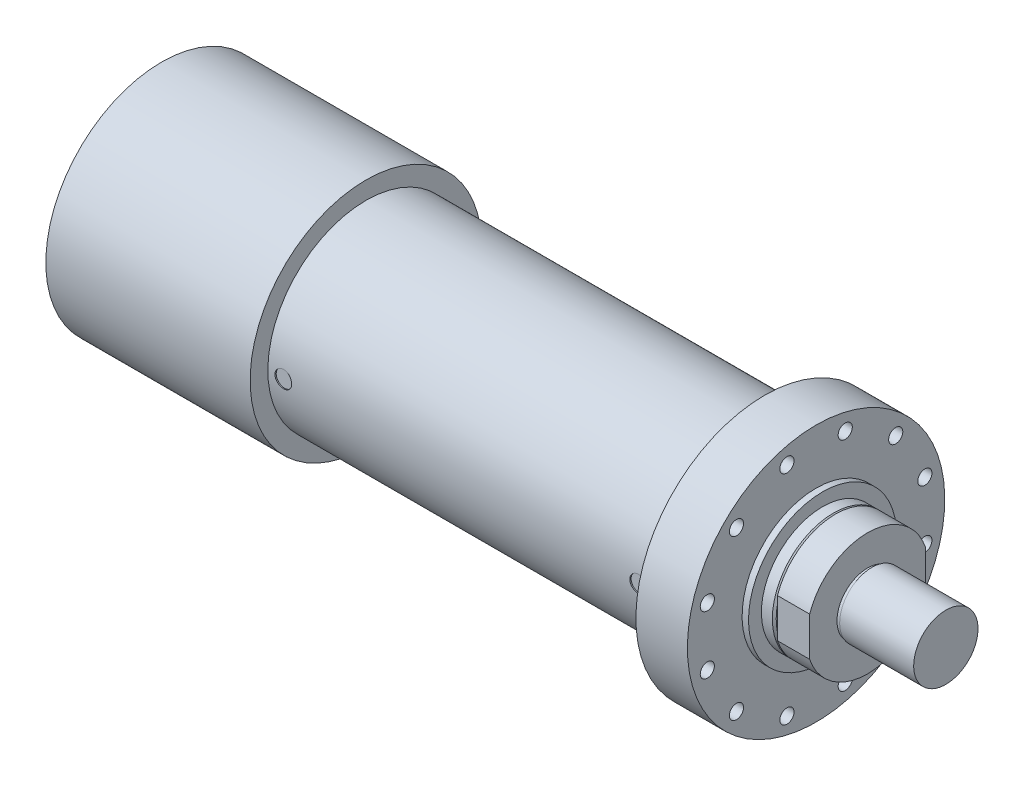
ISO-10303-21;
HEADER;
FILE_DESCRIPTION(('STEP AP214'),'2;1');
FILE_NAME('part.step','',(''),(''),'','','');
FILE_SCHEMA(('AUTOMOTIVE_DESIGN { 1 0 10303 214 1 1 1 1 }'));
ENDSEC;
DATA;
#1=APPLICATION_CONTEXT('core data for automotive mechanical design processes');
#2=APPLICATION_PROTOCOL_DEFINITION('international standard','automotive_design',2000,#1);
#3=PRODUCT_CONTEXT('',#1,'mechanical');
#4=PRODUCT('Part','Part','',(#3));
#5=PRODUCT_RELATED_PRODUCT_CATEGORY('part','',(#4));
#6=PRODUCT_DEFINITION_FORMATION('','',#4);
#7=PRODUCT_DEFINITION_CONTEXT('part definition',#1,'design');
#8=PRODUCT_DEFINITION('design','',#6,#7);
#9=PRODUCT_DEFINITION_SHAPE('','',#8);
#10=(LENGTH_UNIT() NAMED_UNIT(*) SI_UNIT(.MILLI.,.METRE.));
#11=(NAMED_UNIT(*) PLANE_ANGLE_UNIT() SI_UNIT($,.RADIAN.));
#12=(NAMED_UNIT(*) SI_UNIT($,.STERADIAN.) SOLID_ANGLE_UNIT());
#13=UNCERTAINTY_MEASURE_WITH_UNIT(LENGTH_MEASURE(1.E-05),#10,'distance_accuracy_value','');
#14=(GEOMETRIC_REPRESENTATION_CONTEXT(3) GLOBAL_UNCERTAINTY_ASSIGNED_CONTEXT((#13)) GLOBAL_UNIT_ASSIGNED_CONTEXT((#10,
#11,#12)) REPRESENTATION_CONTEXT('',''));
#15=CARTESIAN_POINT('',(0.,0.,0.));
#16=DIRECTION('',(0.,0.,1.));
#17=DIRECTION('',(1.,0.,0.));
#18=AXIS2_PLACEMENT_3D('',#15,#16,#17);
#19=CARTESIAN_POINT('',(729.5,0.,0.));
#20=DIRECTION('',(1.,0.,0.));
#21=DIRECTION('',(0.,1.,0.));
#22=AXIS2_PLACEMENT_3D('',#19,#20,#21);
#23=PLANE('',#22);
#24=DIRECTION('',(0.,-1.,0.));
#25=VECTOR('',#24,1.);
#26=CARTESIAN_POINT('',(729.5,30.4138126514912,90.));
#27=LINE('',#26,#25);
#28=CARTESIAN_POINT('',(729.5,19.0787840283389,90.));
#29=VERTEX_POINT('',#28);
#30=CARTESIAN_POINT('',(729.5,-19.0787840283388,90.));
#31=VERTEX_POINT('',#30);
#32=EDGE_CURVE('E50',#29,#31,#27,.T.);
#33=ORIENTED_EDGE('',*,*,#32,.F.);
#34=CARTESIAN_POINT('',(729.5,0.,0.));
#35=DIRECTION('',(1.,0.,0.));
#36=DIRECTION('',(0.,1.,0.));
#37=AXIS2_PLACEMENT_3D('',#34,#35,#36);
#38=CIRCLE('',#37,92.);
#39=EDGE_CURVE('E237',#29,#31,#38,.T.);
#40=ORIENTED_EDGE('',*,*,#39,.T.);
#41=EDGE_LOOP('',(#33,#40));
#42=FACE_BOUND('',#41,.T.);
#43=ADVANCED_FACE('F37',(#42),#23,.T.);
#44=CARTESIAN_POINT('',(619.5,0.,0.));
#45=DIRECTION('',(1.,0.,0.));
#46=DIRECTION('',(0.,1.,0.));
#47=AXIS2_PLACEMENT_3D('',#44,#45,#46);
#48=CYLINDRICAL_SURFACE('',#47,152.5);
#49=CARTESIAN_POINT('',(37.,0.,152.5));
#50=CARTESIAN_POINT('',(37.0000033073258,0.364527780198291,152.500000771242));
#51=CARTESIAN_POINT('',(36.9846617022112,0.729004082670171,152.498690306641));
#52=CARTESIAN_POINT('',(36.9234072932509,1.45547775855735,152.493486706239));
#53=CARTESIAN_POINT('',(36.8774869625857,1.81747449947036,152.489592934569));
#54=CARTESIAN_POINT('',(36.7553357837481,2.53664977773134,152.479326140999));
#55=CARTESIAN_POINT('',(36.6790744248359,2.89382308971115,152.472950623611));
#56=CARTESIAN_POINT('',(36.4967964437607,3.60044561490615,152.457901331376));
#57=CARTESIAN_POINT('',(36.39077988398,3.94989484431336,152.449227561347));
#58=CARTESIAN_POINT('',(36.1498269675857,4.63838876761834,152.429832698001));
#59=CARTESIAN_POINT('',(36.0149074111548,4.97743937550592,152.419112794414));
#60=CARTESIAN_POINT('',(35.7170781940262,5.642958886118,152.395924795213));
#61=CARTESIAN_POINT('',(35.554168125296,5.96942760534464,152.383456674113));
#62=CARTESIAN_POINT('',(35.2015604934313,6.60740884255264,152.357126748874));
#63=CARTESIAN_POINT('',(35.0118688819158,6.91892466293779,152.343265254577));
#64=CARTESIAN_POINT('',(34.6070163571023,7.52489065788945,152.314536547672));
#65=CARTESIAN_POINT('',(34.3918554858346,7.8193408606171,152.299669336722));
#66=CARTESIAN_POINT('',(33.9370449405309,8.38978645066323,152.269311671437));
#67=CARTESIAN_POINT('',(33.6973386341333,8.66573661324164,152.253819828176));
#68=CARTESIAN_POINT('',(33.1955529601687,9.19647621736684,152.222683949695));
#69=CARTESIAN_POINT('',(32.9334735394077,9.45126560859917,152.207039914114));
#70=CARTESIAN_POINT('',(32.3887761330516,9.93789802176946,152.176041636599));
#71=CARTESIAN_POINT('',(32.1061572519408,10.169740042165,152.160687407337));
#72=CARTESIAN_POINT('',(31.5223804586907,10.608826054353,152.130704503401));
#73=CARTESIAN_POINT('',(31.2212225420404,10.8160700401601,152.116075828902));
#74=CARTESIAN_POINT('',(30.6020143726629,11.2047864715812,152.087937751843));
#75=CARTESIAN_POINT('',(30.2839389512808,11.3862189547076,152.074430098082));
#76=CARTESIAN_POINT('',(29.6335710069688,11.7216359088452,152.04894460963));
#77=CARTESIAN_POINT('',(29.3012784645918,11.8756203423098,152.036966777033));
#78=CARTESIAN_POINT('',(28.6248405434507,12.1550301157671,152.01488379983));
#79=CARTESIAN_POINT('',(28.2806953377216,12.2804558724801,152.004778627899));
#80=CARTESIAN_POINT('',(27.5829993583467,12.5018423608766,151.986730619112));
#81=CARTESIAN_POINT('',(27.229448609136,12.5978031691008,151.978787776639));
#82=CARTESIAN_POINT('',(26.5163423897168,12.7593632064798,151.965309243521));
#83=CARTESIAN_POINT('',(26.1568037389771,12.8250361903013,151.959767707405));
#84=CARTESIAN_POINT('',(25.433444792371,12.925888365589,151.951222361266));
#85=CARTESIAN_POINT('',(25.0696245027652,12.9610676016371,151.948218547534));
#86=CARTESIAN_POINT('',(24.3403080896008,13.0006752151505,151.94483486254));
#87=CARTESIAN_POINT('',(23.9748119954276,13.0051041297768,151.944454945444));
#88=CARTESIAN_POINT('',(23.2447512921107,12.9831801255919,151.946329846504));
#89=CARTESIAN_POINT('',(22.880186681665,12.956827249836,151.948584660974));
#90=CARTESIAN_POINT('',(22.1555494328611,12.8736419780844,151.955654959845));
#91=CARTESIAN_POINT('',(21.795467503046,12.8168899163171,151.960463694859));
#92=CARTESIAN_POINT('',(21.0813784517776,12.6733688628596,151.972500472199));
#93=CARTESIAN_POINT('',(20.7273713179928,12.5865999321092,151.979728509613));
#94=CARTESIAN_POINT('',(20.0279352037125,12.3836707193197,151.996398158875));
#95=CARTESIAN_POINT('',(19.6825062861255,12.2675102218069,152.005839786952));
#96=CARTESIAN_POINT('',(19.0026665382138,12.0066322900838,152.026668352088));
#97=CARTESIAN_POINT('',(18.6682557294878,11.8619147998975,152.038055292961));
#98=CARTESIAN_POINT('',(18.0123775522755,11.5447495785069,152.062467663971));
#99=CARTESIAN_POINT('',(17.6909276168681,11.3722659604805,152.075495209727));
#100=CARTESIAN_POINT('',(17.0636934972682,11.0009309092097,152.102807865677));
#101=CARTESIAN_POINT('',(16.7579093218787,10.8020794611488,152.117092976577));
#102=CARTESIAN_POINT('',(16.1641463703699,10.3794123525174,152.146517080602));
#103=CARTESIAN_POINT('',(15.8761679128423,10.1555962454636,152.161656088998));
#104=CARTESIAN_POINT('',(15.3200399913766,9.68457943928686,152.19236052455));
#105=CARTESIAN_POINT('',(15.0518905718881,9.43737868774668,152.207925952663));
#106=CARTESIAN_POINT('',(14.5364766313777,8.92050188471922,152.239094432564));
#107=CARTESIAN_POINT('',(14.2892817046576,8.65075642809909,152.254697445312));
#108=CARTESIAN_POINT('',(13.8184873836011,8.09138051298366,152.28544908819));
#109=CARTESIAN_POINT('',(13.5948880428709,7.80175000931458,152.300597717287));
#110=CARTESIAN_POINT('',(13.1728706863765,7.20464631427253,152.330011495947));
#111=CARTESIAN_POINT('',(12.9744527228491,6.89717308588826,152.344276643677));
#112=CARTESIAN_POINT('',(12.6042128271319,6.2665559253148,152.371519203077));
#113=CARTESIAN_POINT('',(12.4323908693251,5.94341200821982,152.384496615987));
#114=CARTESIAN_POINT('',(12.1165555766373,5.28370192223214,152.408797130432));
#115=CARTESIAN_POINT('',(11.9725454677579,4.94713420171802,152.420120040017));
#116=CARTESIAN_POINT('',(11.7133968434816,4.26300144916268,152.44078824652));
#117=CARTESIAN_POINT('',(11.5982583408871,3.91543641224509,152.450133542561));
#118=CARTESIAN_POINT('',(11.3976896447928,3.21179186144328,152.466580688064));
#119=CARTESIAN_POINT('',(11.3122589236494,2.85571249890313,152.473682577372));
#120=CARTESIAN_POINT('',(11.1717256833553,2.13757884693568,152.485440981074));
#121=CARTESIAN_POINT('',(11.1166230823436,1.77552457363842,152.490097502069));
#122=CARTESIAN_POINT('',(11.0372732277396,1.04917458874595,152.496822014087));
#123=CARTESIAN_POINT('',(11.0129299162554,0.684889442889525,152.498898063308));
#124=CARTESIAN_POINT('',(10.9949592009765,-0.044442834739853,152.500429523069));
#125=CARTESIAN_POINT('',(11.0013317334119,-0.409489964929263,152.499884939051));
#126=CARTESIAN_POINT('',(11.0447459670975,-1.13773893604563,152.496190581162));
#127=CARTESIAN_POINT('',(11.0817873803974,-1.50094079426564,152.493040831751));
#128=CARTESIAN_POINT('',(11.1862693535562,-2.22291416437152,152.484225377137));
#129=CARTESIAN_POINT('',(11.2537099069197,-2.58168567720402,152.478559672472));
#130=CARTESIAN_POINT('',(11.4183772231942,-3.29171452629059,152.464882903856));
#131=CARTESIAN_POINT('',(11.5155593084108,-3.64298229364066,152.45687535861));
#132=CARTESIAN_POINT('',(11.739043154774,-4.3360715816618,152.438737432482));
#133=CARTESIAN_POINT('',(11.8653448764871,-4.67789311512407,152.428607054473));
#134=CARTESIAN_POINT('',(12.1461646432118,-5.34968508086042,152.406508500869));
#135=CARTESIAN_POINT('',(12.3006830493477,-5.67965536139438,152.394540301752));
#136=CARTESIAN_POINT('',(12.6368342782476,-6.3254224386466,152.369102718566));
#137=CARTESIAN_POINT('',(12.8184671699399,-6.64121919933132,152.35563333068));
#138=CARTESIAN_POINT('',(13.2080390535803,-7.25718258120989,152.327537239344));
#139=CARTESIAN_POINT('',(13.4160415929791,-7.5573088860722,152.31290777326));
#140=CARTESIAN_POINT('',(13.8565284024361,-8.13898511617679,152.282933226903));
#141=CARTESIAN_POINT('',(14.089012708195,-8.42053501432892,152.267588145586));
#142=CARTESIAN_POINT('',(14.5768273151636,-8.96308537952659,152.236615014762));
#143=CARTESIAN_POINT('',(14.8321579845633,-9.22408551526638,152.220986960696));
#144=CARTESIAN_POINT('',(15.3638664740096,-9.72369680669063,152.189889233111));
#145=CARTESIAN_POINT('',(15.6402443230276,-9.96230793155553,152.174419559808));
#146=CARTESIAN_POINT('',(16.2128517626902,-10.4160505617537,152.144036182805));
#147=CARTESIAN_POINT('',(16.5091312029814,-10.631119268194,152.129124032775));
#148=CARTESIAN_POINT('',(17.1188039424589,-11.0355314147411,152.100322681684));
#149=CARTESIAN_POINT('',(17.4321972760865,-11.2248748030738,152.086433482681));
#150=CARTESIAN_POINT('',(18.0738783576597,-11.5764816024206,152.060074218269));
#151=CARTESIAN_POINT('',(18.4021659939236,-11.7387452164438,152.047604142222));
#152=CARTESIAN_POINT('',(19.0713091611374,-12.0350276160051,152.024439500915));
#153=CARTESIAN_POINT('',(19.4121646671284,-12.1690464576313,152.013744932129));
#154=CARTESIAN_POINT('',(20.1035658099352,-12.4077143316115,151.994450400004));
#155=CARTESIAN_POINT('',(20.4540981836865,-12.5124015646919,151.9858477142));
#156=CARTESIAN_POINT('',(21.162783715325,-12.691879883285,151.970965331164));
#157=CARTESIAN_POINT('',(21.5209368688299,-12.7666709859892,151.964685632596));
#158=CARTESIAN_POINT('',(22.2423000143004,-12.8858111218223,151.954629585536));
#159=CARTESIAN_POINT('',(22.6055099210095,-12.9301606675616,151.95085319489));
#160=CARTESIAN_POINT('',(23.3343924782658,-12.9880954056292,151.945912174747));
#161=CARTESIAN_POINT('',(23.7000651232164,-13.001680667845,151.944747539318));
#162=CARTESIAN_POINT('',(24.4300823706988,-12.9979936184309,151.94506297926));
#163=CARTESIAN_POINT('',(24.7944274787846,-12.980819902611,151.94653460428));
#164=CARTESIAN_POINT('',(25.520367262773,-12.9159313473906,151.952064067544));
#165=CARTESIAN_POINT('',(25.8819619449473,-12.8682165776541,151.956121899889));
#166=CARTESIAN_POINT('',(26.5998303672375,-12.7425924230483,151.966707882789));
#167=CARTESIAN_POINT('',(26.9561041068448,-12.6646830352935,151.973236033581));
#168=CARTESIAN_POINT('',(27.6608038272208,-12.4792333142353,151.988576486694));
#169=CARTESIAN_POINT('',(28.0092298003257,-12.3716929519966,151.997388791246));
#170=CARTESIAN_POINT('',(28.6957457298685,-12.1277642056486,152.017046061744));
#171=CARTESIAN_POINT('',(29.033836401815,-11.9913778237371,152.027890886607));
#172=CARTESIAN_POINT('',(29.6973243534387,-11.6907291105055,152.05130572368));
#173=CARTESIAN_POINT('',(30.0227216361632,-11.5264667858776,152.063875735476));
#174=CARTESIAN_POINT('',(30.6585313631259,-11.1712384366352,152.090384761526));
#175=CARTESIAN_POINT('',(30.9689440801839,-10.9802728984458,152.104323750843));
#176=CARTESIAN_POINT('',(31.5726163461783,-10.5729871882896,152.133177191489));
#177=CARTESIAN_POINT('',(31.8658758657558,-10.3566669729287,152.14809164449));
#178=CARTESIAN_POINT('',(32.4340581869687,-9.89949631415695,152.178522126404));
#179=CARTESIAN_POINT('',(32.7089221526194,-9.65857285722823,152.194039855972));
#180=CARTESIAN_POINT('',(33.2373936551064,-9.15444787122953,152.225194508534));
#181=CARTESIAN_POINT('',(33.4910010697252,-8.89124621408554,152.240831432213));
#182=CARTESIAN_POINT('',(33.9752303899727,-8.34435162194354,152.271785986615));
#183=CARTESIAN_POINT('',(34.2058465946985,-8.06065363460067,152.287103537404));
#184=CARTESIAN_POINT('',(34.6423874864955,-7.47482626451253,152.316981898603));
#185=CARTESIAN_POINT('',(34.8483125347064,-7.17269715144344,152.331542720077));
#186=CARTESIAN_POINT('',(35.2343871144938,-6.55152875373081,152.359523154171));
#187=CARTESIAN_POINT('',(35.4144858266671,-6.23245777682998,152.372940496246));
#188=CARTESIAN_POINT('',(35.7471400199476,-5.58020865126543,152.398221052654));
#189=CARTESIAN_POINT('',(35.8996954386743,-5.24703047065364,152.410084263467));
#190=CARTESIAN_POINT('',(36.1760215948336,-4.56927481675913,152.431907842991));
#191=CARTESIAN_POINT('',(36.2998217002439,-4.22470938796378,152.441870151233));
#192=CARTESIAN_POINT('',(36.5179106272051,-3.52643001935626,152.459621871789));
#193=CARTESIAN_POINT('',(36.6122068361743,-3.17271839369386,152.467411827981));
#194=CARTESIAN_POINT('',(36.7938522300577,-2.3539064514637,152.482530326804));
#195=CARTESIAN_POINT('',(36.8710857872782,-1.88651179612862,152.489056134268));
#196=CARTESIAN_POINT('',(36.9741574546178,-0.946049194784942,152.49779046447));
#197=CARTESIAN_POINT('',(36.9999957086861,-0.472981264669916,152.4999989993));
#198=CARTESIAN_POINT('',(37.,0.,152.5));
#199=B_SPLINE_CURVE_WITH_KNOTS('',3,(#49,#50,#51,#52,#53,#54,#55,#56,#57,#58,#59,#60,#61,#62,
#63,#64,#65,#66,#67,#68,#69,#70,#71,#72,#73,#74,#75,#76,#77,#78,#79,#80,#81,#82,#83,#84,#85,#86,
#87,#88,#89,#90,#91,#92,#93,#94,#95,#96,#97,#98,#99,#100,#101,#102,#103,#104,#105,#106,#107,
#108,#109,#110,#111,#112,#113,#114,#115,#116,#117,#118,#119,#120,#121,#122,#123,#124,#125,#126,
#127,#128,#129,#130,#131,#132,#133,#134,#135,#136,#137,#138,#139,#140,#141,#142,#143,#144,#145,
#146,#147,#148,#149,#150,#151,#152,#153,#154,#155,#156,#157,#158,#159,#160,#161,#162,#163,#164,
#165,#166,#167,#168,#169,#170,#171,#172,#173,#174,#175,#176,#177,#178,#179,#180,#181,#182,#183,
#184,#185,#186,#187,#188,#189,#190,#191,#192,#193,#194,#195,#196,#197,#198),.UNSPECIFIED.,.T.,
.F.,(4,2,2,2,2,2,2,2,2,2,2,2,2,2,2,2,2,2,2,2,2,2,2,2,2,2,2,2,2,2,2,2,2,2,2,2,2,2,2,2,2,2,2,2,2,
2,2,2,2,2,2,2,2,2,2,2,2,2,2,2,2,2,2,2,2,2,2,2,2,2,2,2,2,2,4),(0.,1.09316985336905,
2.18660888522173,3.28115026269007,4.37568934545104,5.46959393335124,6.5635144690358,
7.65719228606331,8.75086829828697,9.84712711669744,10.9433885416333,12.0396977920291,
13.1360073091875,14.2339961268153,15.33198644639,16.4299607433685,17.5279321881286,
18.6232156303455,19.7184974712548,20.81376017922,21.9090213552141,23.0014023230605,
24.093781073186,25.1861678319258,26.2785567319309,27.3723690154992,28.4661819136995,
29.560014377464,30.6538492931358,31.7511852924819,32.848523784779,33.9458645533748,
35.0432042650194,36.1406711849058,37.2381385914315,38.3355865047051,39.43303145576,
40.5270406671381,41.6210476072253,42.7150442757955,43.8090407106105,44.9014017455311,
45.9937613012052,47.086134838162,48.1785111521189,49.2735718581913,50.368634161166,
51.4637141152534,52.5587955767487,53.6567304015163,54.7546674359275,55.8525962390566,
56.9505228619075,58.0470128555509,59.1435022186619,60.2399731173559,61.3364415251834,
62.4294015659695,63.5223591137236,64.6153167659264,65.7082754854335,66.8011583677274,
67.8940409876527,68.986903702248,70.0797682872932,71.1759759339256,72.2721898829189,
73.36867497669,74.465144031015,75.5637418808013,76.662342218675,77.7598155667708,
78.8570139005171,80.2754251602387,81.693832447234),.UNSPECIFIED.);
#200=CARTESIAN_POINT('',(37.,0.,152.5));
#201=VERTEX_POINT('',#200);
#202=EDGE_CURVE('E41',#201,#201,#199,.T.);
#203=ORIENTED_EDGE('',*,*,#202,.F.);
#204=EDGE_LOOP('',(#203));
#205=FACE_BOUND('',#204,.T.);
#206=CARTESIAN_POINT('',(588.5,0.,152.5));
#207=CARTESIAN_POINT('',(588.500003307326,0.364527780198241,152.500000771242));
#208=CARTESIAN_POINT('',(588.484661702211,0.729004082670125,152.498690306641));
#209=CARTESIAN_POINT('',(588.423407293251,1.45547775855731,152.493486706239));
#210=CARTESIAN_POINT('',(588.377486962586,1.81747449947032,152.489592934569));
#211=CARTESIAN_POINT('',(588.255335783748,2.5366497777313,152.479326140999));
#212=CARTESIAN_POINT('',(588.179074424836,2.89382308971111,152.472950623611));
#213=CARTESIAN_POINT('',(587.996796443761,3.60044561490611,152.457901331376));
#214=CARTESIAN_POINT('',(587.89077988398,3.94989484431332,152.449227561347));
#215=CARTESIAN_POINT('',(587.649826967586,4.63838876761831,152.429832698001));
#216=CARTESIAN_POINT('',(587.514907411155,4.9774393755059,152.419112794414));
#217=CARTESIAN_POINT('',(587.217078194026,5.64295888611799,152.395924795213));
#218=CARTESIAN_POINT('',(587.054168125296,5.96942760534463,152.383456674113));
#219=CARTESIAN_POINT('',(586.701560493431,6.60740884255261,152.357126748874));
#220=CARTESIAN_POINT('',(586.511868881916,6.91892466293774,152.343265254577));
#221=CARTESIAN_POINT('',(586.107016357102,7.52489065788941,152.314536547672));
#222=CARTESIAN_POINT('',(585.891855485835,7.81934086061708,152.299669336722));
#223=CARTESIAN_POINT('',(585.437044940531,8.38978645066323,152.269311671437));
#224=CARTESIAN_POINT('',(585.197338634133,8.66573661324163,152.253819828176));
#225=CARTESIAN_POINT('',(584.695552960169,9.19647621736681,152.222683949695));
#226=CARTESIAN_POINT('',(584.433473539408,9.45126560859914,152.207039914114));
#227=CARTESIAN_POINT('',(583.888776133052,9.93789802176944,152.176041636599));
#228=CARTESIAN_POINT('',(583.606157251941,10.1697400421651,152.160687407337));
#229=CARTESIAN_POINT('',(583.022380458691,10.6088260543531,152.130704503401));
#230=CARTESIAN_POINT('',(582.72122254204,10.8160700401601,152.116075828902));
#231=CARTESIAN_POINT('',(582.102014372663,11.2047864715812,152.087937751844));
#232=CARTESIAN_POINT('',(581.783938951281,11.3862189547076,152.074430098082));
#233=CARTESIAN_POINT('',(581.133571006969,11.7216359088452,152.04894460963));
#234=CARTESIAN_POINT('',(580.801278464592,11.8756203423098,152.036966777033));
#235=CARTESIAN_POINT('',(580.124840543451,12.1550301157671,152.01488379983));
#236=CARTESIAN_POINT('',(579.780695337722,12.2804558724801,152.004778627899));
#237=CARTESIAN_POINT('',(579.082999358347,12.5018423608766,151.986730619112));
#238=CARTESIAN_POINT('',(578.729448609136,12.5978031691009,151.978787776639));
#239=CARTESIAN_POINT('',(578.016342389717,12.7593632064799,151.965309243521));
#240=CARTESIAN_POINT('',(577.656803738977,12.8250361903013,151.959767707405));
#241=CARTESIAN_POINT('',(576.933444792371,12.925888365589,151.951222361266));
#242=CARTESIAN_POINT('',(576.569624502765,12.9610676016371,151.948218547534));
#243=CARTESIAN_POINT('',(575.840308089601,13.0006752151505,151.94483486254));
#244=CARTESIAN_POINT('',(575.474811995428,13.0051041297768,151.944454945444));
#245=CARTESIAN_POINT('',(574.744751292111,12.9831801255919,151.946329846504));
#246=CARTESIAN_POINT('',(574.380186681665,12.956827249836,151.948584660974));
#247=CARTESIAN_POINT('',(573.655549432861,12.8736419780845,151.955654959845));
#248=CARTESIAN_POINT('',(573.295467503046,12.8168899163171,151.960463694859));
#249=CARTESIAN_POINT('',(572.581378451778,12.6733688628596,151.972500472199));
#250=CARTESIAN_POINT('',(572.227371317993,12.5865999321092,151.979728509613));
#251=CARTESIAN_POINT('',(571.527935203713,12.3836707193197,151.996398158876));
#252=CARTESIAN_POINT('',(571.182506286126,12.2675102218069,152.005839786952));
#253=CARTESIAN_POINT('',(570.502666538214,12.0066322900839,152.026668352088));
#254=CARTESIAN_POINT('',(570.168255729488,11.8619147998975,152.038055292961));
#255=CARTESIAN_POINT('',(569.512377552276,11.5447495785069,152.062467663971));
#256=CARTESIAN_POINT('',(569.190927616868,11.3722659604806,152.075495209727));
#257=CARTESIAN_POINT('',(568.563693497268,11.0009309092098,152.102807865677));
#258=CARTESIAN_POINT('',(568.257909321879,10.8020794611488,152.117092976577));
#259=CARTESIAN_POINT('',(567.66414637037,10.3794123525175,152.146517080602));
#260=CARTESIAN_POINT('',(567.376167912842,10.1555962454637,152.161656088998));
#261=CARTESIAN_POINT('',(566.820039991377,9.6845794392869,152.19236052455));
#262=CARTESIAN_POINT('',(566.551890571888,9.43737868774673,152.207925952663));
#263=CARTESIAN_POINT('',(566.036476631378,8.92050188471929,152.239094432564));
#264=CARTESIAN_POINT('',(565.789281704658,8.65075642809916,152.254697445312));
#265=CARTESIAN_POINT('',(565.318487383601,8.09138051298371,152.28544908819));
#266=CARTESIAN_POINT('',(565.094888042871,7.80175000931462,152.300597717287));
#267=CARTESIAN_POINT('',(564.672870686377,7.20464631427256,152.330011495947));
#268=CARTESIAN_POINT('',(564.474452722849,6.8971730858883,152.344276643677));
#269=CARTESIAN_POINT('',(564.104212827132,6.26655592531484,152.371519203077));
#270=CARTESIAN_POINT('',(563.932390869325,5.94341200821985,152.384496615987));
#271=CARTESIAN_POINT('',(563.616555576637,5.28370192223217,152.408797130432));
#272=CARTESIAN_POINT('',(563.472545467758,4.94713420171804,152.420120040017));
#273=CARTESIAN_POINT('',(563.213396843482,4.26300144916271,152.44078824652));
#274=CARTESIAN_POINT('',(563.098258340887,3.91543641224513,152.450133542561));
#275=CARTESIAN_POINT('',(562.897689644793,3.21179186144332,152.466580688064));
#276=CARTESIAN_POINT('',(562.812258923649,2.85571249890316,152.473682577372));
#277=CARTESIAN_POINT('',(562.671725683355,2.13757884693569,152.485440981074));
#278=CARTESIAN_POINT('',(562.616623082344,1.77552457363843,152.490097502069));
#279=CARTESIAN_POINT('',(562.53727322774,1.04917458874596,152.496822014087));
#280=CARTESIAN_POINT('',(562.512929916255,0.684889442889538,152.498898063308));
#281=CARTESIAN_POINT('',(562.494959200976,-0.0444428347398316,152.500429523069));
#282=CARTESIAN_POINT('',(562.501331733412,-0.409489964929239,152.499884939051));
#283=CARTESIAN_POINT('',(562.544745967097,-1.1377389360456,152.496190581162));
#284=CARTESIAN_POINT('',(562.581787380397,-1.5009407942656,152.493040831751));
#285=CARTESIAN_POINT('',(562.686269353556,-2.22291416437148,152.484225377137));
#286=CARTESIAN_POINT('',(562.75370990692,-2.58168567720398,152.478559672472));
#287=CARTESIAN_POINT('',(562.918377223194,-3.29171452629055,152.464882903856));
#288=CARTESIAN_POINT('',(563.015559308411,-3.64298229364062,152.45687535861));
#289=CARTESIAN_POINT('',(563.239043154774,-4.33607158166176,152.438737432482));
#290=CARTESIAN_POINT('',(563.365344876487,-4.67789311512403,152.428607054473));
#291=CARTESIAN_POINT('',(563.646164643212,-5.34968508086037,152.406508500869));
#292=CARTESIAN_POINT('',(563.800683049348,-5.67965536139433,152.394540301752));
#293=CARTESIAN_POINT('',(564.136834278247,-6.32542243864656,152.369102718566));
#294=CARTESIAN_POINT('',(564.31846716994,-6.64121919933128,152.35563333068));
#295=CARTESIAN_POINT('',(564.70803905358,-7.25718258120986,152.327537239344));
#296=CARTESIAN_POINT('',(564.916041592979,-7.55730888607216,152.31290777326));
#297=CARTESIAN_POINT('',(565.356528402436,-8.13898511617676,152.282933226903));
#298=CARTESIAN_POINT('',(565.589012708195,-8.4205350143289,152.267588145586));
#299=CARTESIAN_POINT('',(566.076827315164,-8.96308537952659,152.236615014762));
#300=CARTESIAN_POINT('',(566.332157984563,-9.22408551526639,152.220986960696));
#301=CARTESIAN_POINT('',(566.86386647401,-9.72369680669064,152.189889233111));
#302=CARTESIAN_POINT('',(567.140244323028,-9.96230793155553,152.174419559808));
#303=CARTESIAN_POINT('',(567.71285176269,-10.4160505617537,152.144036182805));
#304=CARTESIAN_POINT('',(568.009131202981,-10.631119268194,152.129124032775));
#305=CARTESIAN_POINT('',(568.618803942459,-11.0355314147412,152.100322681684));
#306=CARTESIAN_POINT('',(568.932197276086,-11.2248748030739,152.086433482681));
#307=CARTESIAN_POINT('',(569.57387835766,-11.5764816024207,152.060074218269));
#308=CARTESIAN_POINT('',(569.902165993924,-11.7387452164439,152.047604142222));
#309=CARTESIAN_POINT('',(570.571309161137,-12.0350276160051,152.024439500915));
#310=CARTESIAN_POINT('',(570.912164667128,-12.1690464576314,152.013744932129));
#311=CARTESIAN_POINT('',(571.603565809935,-12.4077143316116,151.994450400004));
#312=CARTESIAN_POINT('',(571.954098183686,-12.512401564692,151.9858477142));
#313=CARTESIAN_POINT('',(572.662783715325,-12.691879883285,151.970965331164));
#314=CARTESIAN_POINT('',(573.02093686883,-12.7666709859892,151.964685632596));
#315=CARTESIAN_POINT('',(573.7423000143,-12.8858111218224,151.954629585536));
#316=CARTESIAN_POINT('',(574.105509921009,-12.9301606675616,151.95085319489));
#317=CARTESIAN_POINT('',(574.834392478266,-12.9880954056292,151.945912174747));
#318=CARTESIAN_POINT('',(575.200065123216,-13.001680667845,151.944747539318));
#319=CARTESIAN_POINT('',(575.930082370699,-12.997993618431,151.94506297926));
#320=CARTESIAN_POINT('',(576.294427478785,-12.9808199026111,151.94653460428));
#321=CARTESIAN_POINT('',(577.020367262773,-12.9159313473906,151.952064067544));
#322=CARTESIAN_POINT('',(577.381961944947,-12.8682165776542,151.956121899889));
#323=CARTESIAN_POINT('',(578.099830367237,-12.7425924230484,151.966707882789));
#324=CARTESIAN_POINT('',(578.456104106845,-12.6646830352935,151.973236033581));
#325=CARTESIAN_POINT('',(579.160803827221,-12.4792333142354,151.988576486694));
#326=CARTESIAN_POINT('',(579.509229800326,-12.3716929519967,151.997388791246));
#327=CARTESIAN_POINT('',(580.195745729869,-12.1277642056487,152.017046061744));
#328=CARTESIAN_POINT('',(580.533836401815,-11.9913778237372,152.027890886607));
#329=CARTESIAN_POINT('',(581.197324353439,-11.6907291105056,152.05130572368));
#330=CARTESIAN_POINT('',(581.522721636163,-11.5264667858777,152.063875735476));
#331=CARTESIAN_POINT('',(582.158531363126,-11.1712384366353,152.090384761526));
#332=CARTESIAN_POINT('',(582.468944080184,-10.9802728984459,152.104323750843));
#333=CARTESIAN_POINT('',(583.072616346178,-10.5729871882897,152.133177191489));
#334=CARTESIAN_POINT('',(583.365875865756,-10.3566669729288,152.14809164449));
#335=CARTESIAN_POINT('',(583.934058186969,-9.89949631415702,152.178522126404));
#336=CARTESIAN_POINT('',(584.208922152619,-9.65857285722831,152.194039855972));
#337=CARTESIAN_POINT('',(584.737393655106,-9.15444787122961,152.225194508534));
#338=CARTESIAN_POINT('',(584.991001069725,-8.89124621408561,152.240831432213));
#339=CARTESIAN_POINT('',(585.475230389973,-8.3443516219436,152.271785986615));
#340=CARTESIAN_POINT('',(585.705846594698,-8.06065363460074,152.287103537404));
#341=CARTESIAN_POINT('',(586.142387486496,-7.47482626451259,152.316981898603));
#342=CARTESIAN_POINT('',(586.348312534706,-7.17269715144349,152.331542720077));
#343=CARTESIAN_POINT('',(586.734387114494,-6.55152875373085,152.359523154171));
#344=CARTESIAN_POINT('',(586.914485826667,-6.23245777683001,152.372940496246));
#345=CARTESIAN_POINT('',(587.247140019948,-5.58020865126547,152.398221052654));
#346=CARTESIAN_POINT('',(587.399695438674,-5.2470304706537,152.410084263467));
#347=CARTESIAN_POINT('',(587.676021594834,-4.56927481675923,152.431907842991));
#348=CARTESIAN_POINT('',(587.799821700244,-4.2247093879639,152.441870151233));
#349=CARTESIAN_POINT('',(588.017910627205,-3.52643001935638,152.459621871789));
#350=CARTESIAN_POINT('',(588.112206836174,-3.17271839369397,152.467411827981));
#351=CARTESIAN_POINT('',(588.293852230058,-2.35390645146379,152.482530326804));
#352=CARTESIAN_POINT('',(588.371085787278,-1.8865117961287,152.489056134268));
#353=CARTESIAN_POINT('',(588.474157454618,-0.946049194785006,152.49779046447));
#354=CARTESIAN_POINT('',(588.499995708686,-0.472981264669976,152.4999989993));
#355=CARTESIAN_POINT('',(588.5,0.,152.5));
#356=B_SPLINE_CURVE_WITH_KNOTS('',3,(#206,#207,#208,#209,#210,#211,#212,#213,#214,#215,#216,
#217,#218,#219,#220,#221,#222,#223,#224,#225,#226,#227,#228,#229,#230,#231,#232,#233,#234,#235,
#236,#237,#238,#239,#240,#241,#242,#243,#244,#245,#246,#247,#248,#249,#250,#251,#252,#253,#254,
#255,#256,#257,#258,#259,#260,#261,#262,#263,#264,#265,#266,#267,#268,#269,#270,#271,#272,#273,
#274,#275,#276,#277,#278,#279,#280,#281,#282,#283,#284,#285,#286,#287,#288,#289,#290,#291,#292,
#293,#294,#295,#296,#297,#298,#299,#300,#301,#302,#303,#304,#305,#306,#307,#308,#309,#310,#311,
#312,#313,#314,#315,#316,#317,#318,#319,#320,#321,#322,#323,#324,#325,#326,#327,#328,#329,#330,
#331,#332,#333,#334,#335,#336,#337,#338,#339,#340,#341,#342,#343,#344,#345,#346,#347,#348,#349,
#350,#351,#352,#353,#354,#355),.UNSPECIFIED.,.T.,.F.,(4,2,2,2,2,2,2,2,2,2,2,2,2,2,2,2,2,2,2,2,2,
2,2,2,2,2,2,2,2,2,2,2,2,2,2,2,2,2,2,2,2,2,2,2,2,2,2,2,2,2,2,2,2,2,2,2,2,2,2,2,2,2,2,2,2,2,2,2,2,
2,2,2,2,2,4),(0.,1.09316985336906,2.18660888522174,3.28115026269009,4.37568934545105,
5.46959393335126,6.56351446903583,7.65719228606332,8.75086829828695,9.84712711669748,
10.9433885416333,12.0396977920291,13.1360073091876,14.2339961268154,15.33198644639,
16.4299607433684,17.5279321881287,18.6232156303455,19.7184974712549,20.8137601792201,
21.9090213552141,23.0014023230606,24.093781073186,25.1861678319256,26.2785567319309,
27.3723690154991,28.4661819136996,29.5600143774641,30.6538492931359,31.751185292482,
32.8485237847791,33.9458645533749,35.0432042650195,36.140671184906,37.2381385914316,
38.3355865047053,39.4330314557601,40.5270406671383,41.6210476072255,42.7150442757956,
43.8090407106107,44.9014017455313,45.9937613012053,47.086134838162,48.1785111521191,
49.2735718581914,50.3686341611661,51.4637141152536,52.5587955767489,53.6567304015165,
54.7546674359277,55.8525962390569,56.9505228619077,58.047012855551,59.1435022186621,
60.2399731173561,61.3364415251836,62.4294015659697,63.5223591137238,64.6153167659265,
65.7082754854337,66.8011583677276,67.8940409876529,68.9869037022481,70.0797682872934,
71.1759759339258,72.2721898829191,73.3686749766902,74.4651440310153,75.5637418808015,
76.6623422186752,77.7598155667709,78.8570139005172,80.2754251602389,81.6938324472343),.UNSPECIFIED.);
#357=CARTESIAN_POINT('',(588.5,0.,152.5));
#358=VERTEX_POINT('',#357);
#359=EDGE_CURVE('E248',#358,#358,#356,.T.);
#360=ORIENTED_EDGE('',*,*,#359,.F.);
#361=EDGE_LOOP('',(#360));
#362=FACE_BOUND('',#361,.T.);
#363=CARTESIAN_POINT('',(0.,0.,0.));
#364=DIRECTION('',(1.,0.,0.));
#365=DIRECTION('',(0.,1.,0.));
#366=AXIS2_PLACEMENT_3D('',#363,#364,#365);
#367=CIRCLE('',#366,152.5);
#368=CARTESIAN_POINT('',(0.,152.5,0.));
#369=VERTEX_POINT('',#368);
#370=EDGE_CURVE('E133',#369,#369,#367,.T.);
#371=ORIENTED_EDGE('',*,*,#370,.T.);
#372=EDGE_LOOP('',(#371));
#373=FACE_BOUND('',#372,.T.);
#374=CARTESIAN_POINT('',(619.5,0.,0.));
#375=DIRECTION('',(1.,0.,0.));
#376=DIRECTION('',(0.,1.,0.));
#377=AXIS2_PLACEMENT_3D('',#374,#375,#376);
#378=CIRCLE('',#377,152.5);
#379=CARTESIAN_POINT('',(619.5,152.5,0.));
#380=VERTEX_POINT('',#379);
#381=EDGE_CURVE('E149',#380,#380,#378,.T.);
#382=ORIENTED_EDGE('',*,*,#381,.F.);
#383=EDGE_LOOP('',(#382));
#384=FACE_BOUND('',#383,.T.);
#385=CARTESIAN_POINT('',(31.,0.,-152.5));
#386=CARTESIAN_POINT('',(30.9999966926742,-0.364527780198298,-152.500000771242));
#387=CARTESIAN_POINT('',(31.0153382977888,-0.729004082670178,-152.498690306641));
#388=CARTESIAN_POINT('',(31.0765927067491,-1.45547775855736,-152.493486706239));
#389=CARTESIAN_POINT('',(31.1225130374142,-1.81747449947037,-152.489592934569));
#390=CARTESIAN_POINT('',(31.2446642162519,-2.53664977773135,-152.479326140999));
#391=CARTESIAN_POINT('',(31.3209255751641,-2.89382308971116,-152.472950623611));
#392=CARTESIAN_POINT('',(31.5032035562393,-3.60044561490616,-152.457901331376));
#393=CARTESIAN_POINT('',(31.60922011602,-3.94989484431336,-152.449227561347));
#394=CARTESIAN_POINT('',(31.8501730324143,-4.63838876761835,-152.429832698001));
#395=CARTESIAN_POINT('',(31.9850925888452,-4.97743937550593,-152.419112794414));
#396=CARTESIAN_POINT('',(32.2829218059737,-5.64295888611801,-152.395924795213));
#397=CARTESIAN_POINT('',(32.445831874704,-5.96942760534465,-152.383456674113));
#398=CARTESIAN_POINT('',(32.7984395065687,-6.60740884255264,-152.357126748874));
#399=CARTESIAN_POINT('',(32.9881311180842,-6.91892466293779,-152.343265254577));
#400=CARTESIAN_POINT('',(33.3929836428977,-7.52489065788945,-152.314536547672));
#401=CARTESIAN_POINT('',(33.6081445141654,-7.8193408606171,-152.299669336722));
#402=CARTESIAN_POINT('',(34.0629550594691,-8.38978645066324,-152.269311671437));
#403=CARTESIAN_POINT('',(34.3026613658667,-8.66573661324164,-152.253819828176));
#404=CARTESIAN_POINT('',(34.8044470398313,-9.19647621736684,-152.222683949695));
#405=CARTESIAN_POINT('',(35.0665264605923,-9.45126560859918,-152.207039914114));
#406=CARTESIAN_POINT('',(35.6112238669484,-9.93789802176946,-152.176041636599));
#407=CARTESIAN_POINT('',(35.8938427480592,-10.169740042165,-152.160687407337));
#408=CARTESIAN_POINT('',(36.4776195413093,-10.6088260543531,-152.130704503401));
#409=CARTESIAN_POINT('',(36.7787774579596,-10.8160700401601,-152.116075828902));
#410=CARTESIAN_POINT('',(37.3979856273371,-11.2047864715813,-152.087937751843));
#411=CARTESIAN_POINT('',(37.7160610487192,-11.3862189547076,-152.074430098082));
#412=CARTESIAN_POINT('',(38.3664289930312,-11.7216359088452,-152.04894460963));
#413=CARTESIAN_POINT('',(38.6987215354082,-11.8756203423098,-152.036966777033));
#414=CARTESIAN_POINT('',(39.3751594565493,-12.1550301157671,-152.01488379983));
#415=CARTESIAN_POINT('',(39.7193046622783,-12.2804558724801,-152.004778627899));
#416=CARTESIAN_POINT('',(40.4170006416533,-12.5018423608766,-151.986730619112));
#417=CARTESIAN_POINT('',(40.770551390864,-12.5978031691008,-151.978787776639));
#418=CARTESIAN_POINT('',(41.4836576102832,-12.7593632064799,-151.965309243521));
#419=CARTESIAN_POINT('',(41.8431962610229,-12.8250361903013,-151.959767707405));
#420=CARTESIAN_POINT('',(42.566555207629,-12.925888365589,-151.951222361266));
#421=CARTESIAN_POINT('',(42.9303754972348,-12.9610676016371,-151.948218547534));
#422=CARTESIAN_POINT('',(43.6596919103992,-13.0006752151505,-151.94483486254));
#423=CARTESIAN_POINT('',(44.0251880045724,-13.0051041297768,-151.944454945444));
#424=CARTESIAN_POINT('',(44.7552487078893,-12.9831801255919,-151.946329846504));
#425=CARTESIAN_POINT('',(45.119813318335,-12.956827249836,-151.948584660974));
#426=CARTESIAN_POINT('',(45.8444505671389,-12.8736419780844,-151.955654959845));
#427=CARTESIAN_POINT('',(46.204532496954,-12.8168899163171,-151.960463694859));
#428=CARTESIAN_POINT('',(46.9186215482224,-12.6733688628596,-151.972500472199));
#429=CARTESIAN_POINT('',(47.2726286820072,-12.5865999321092,-151.979728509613));
#430=CARTESIAN_POINT('',(47.9720647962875,-12.3836707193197,-151.996398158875));
#431=CARTESIAN_POINT('',(48.3174937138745,-12.2675102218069,-152.005839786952));
#432=CARTESIAN_POINT('',(48.9973334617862,-12.0066322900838,-152.026668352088));
#433=CARTESIAN_POINT('',(49.3317442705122,-11.8619147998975,-152.038055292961));
#434=CARTESIAN_POINT('',(49.9876224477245,-11.5447495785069,-152.062467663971));
#435=CARTESIAN_POINT('',(50.3090723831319,-11.3722659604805,-152.075495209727));
#436=CARTESIAN_POINT('',(50.9363065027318,-11.0009309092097,-152.102807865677));
#437=CARTESIAN_POINT('',(51.2420906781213,-10.8020794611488,-152.117092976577));
#438=CARTESIAN_POINT('',(51.8358536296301,-10.3794123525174,-152.146517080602));
#439=CARTESIAN_POINT('',(52.1238320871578,-10.1555962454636,-152.161656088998));
#440=CARTESIAN_POINT('',(52.6799600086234,-9.68457943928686,-152.19236052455));
#441=CARTESIAN_POINT('',(52.9481094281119,-9.43737868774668,-152.207925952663));
#442=CARTESIAN_POINT('',(53.4635233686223,-8.92050188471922,-152.239094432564));
#443=CARTESIAN_POINT('',(53.7107182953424,-8.6507564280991,-152.254697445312));
#444=CARTESIAN_POINT('',(54.1815126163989,-8.09138051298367,-152.28544908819));
#445=CARTESIAN_POINT('',(54.4051119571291,-7.80175000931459,-152.300597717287));
#446=CARTESIAN_POINT('',(54.8271293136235,-7.20464631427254,-152.330011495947));
#447=CARTESIAN_POINT('',(55.0255472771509,-6.89717308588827,-152.344276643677));
#448=CARTESIAN_POINT('',(55.3957871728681,-6.26655592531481,-152.371519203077));
#449=CARTESIAN_POINT('',(55.5676091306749,-5.94341200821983,-152.384496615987));
#450=CARTESIAN_POINT('',(55.8834444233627,-5.28370192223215,-152.408797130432));
#451=CARTESIAN_POINT('',(56.0274545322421,-4.94713420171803,-152.420120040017));
#452=CARTESIAN_POINT('',(56.2866031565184,-4.26300144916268,-152.44078824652));
#453=CARTESIAN_POINT('',(56.4017416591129,-3.91543641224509,-152.450133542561));
#454=CARTESIAN_POINT('',(56.6023103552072,-3.21179186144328,-152.466580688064));
#455=CARTESIAN_POINT('',(56.6877410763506,-2.85571249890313,-152.473682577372));
#456=CARTESIAN_POINT('',(56.8282743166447,-2.13757884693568,-152.485440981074));
#457=CARTESIAN_POINT('',(56.8833769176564,-1.77552457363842,-152.490097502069));
#458=CARTESIAN_POINT('',(56.9627267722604,-1.04917458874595,-152.496822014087));
#459=CARTESIAN_POINT('',(56.9870700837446,-0.684889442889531,-152.498898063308));
#460=CARTESIAN_POINT('',(57.0050407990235,0.0444428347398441,-152.500429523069));
#461=CARTESIAN_POINT('',(56.9986682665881,0.409489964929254,-152.499884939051));
#462=CARTESIAN_POINT('',(56.9552540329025,1.13773893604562,-152.496190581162));
#463=CARTESIAN_POINT('',(56.9182126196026,1.50094079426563,-152.493040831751));
#464=CARTESIAN_POINT('',(56.8137306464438,2.22291416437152,-152.484225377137));
#465=CARTESIAN_POINT('',(56.7462900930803,2.58168567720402,-152.478559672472));
#466=CARTESIAN_POINT('',(56.5816227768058,3.29171452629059,-152.464882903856));
#467=CARTESIAN_POINT('',(56.4844406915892,3.64298229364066,-152.45687535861));
#468=CARTESIAN_POINT('',(56.260956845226,4.33607158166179,-152.438737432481));
#469=CARTESIAN_POINT('',(56.1346551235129,4.67789311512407,-152.428607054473));
#470=CARTESIAN_POINT('',(55.8538353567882,5.34968508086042,-152.406508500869));
#471=CARTESIAN_POINT('',(55.6993169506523,5.67965536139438,-152.394540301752));
#472=CARTESIAN_POINT('',(55.3631657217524,6.3254224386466,-152.369102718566));
#473=CARTESIAN_POINT('',(55.1815328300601,6.64121919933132,-152.35563333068));
#474=CARTESIAN_POINT('',(54.7919609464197,7.25718258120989,-152.327537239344));
#475=CARTESIAN_POINT('',(54.5839584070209,7.5573088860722,-152.31290777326));
#476=CARTESIAN_POINT('',(54.1434715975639,8.13898511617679,-152.282933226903));
#477=CARTESIAN_POINT('',(53.910987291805,8.42053501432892,-152.267588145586));
#478=CARTESIAN_POINT('',(53.4231726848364,8.96308537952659,-152.236615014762));
#479=CARTESIAN_POINT('',(53.1678420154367,9.22408551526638,-152.220986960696));
#480=CARTESIAN_POINT('',(52.6361335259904,9.72369680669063,-152.189889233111));
#481=CARTESIAN_POINT('',(52.3597556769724,9.96230793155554,-152.174419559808));
#482=CARTESIAN_POINT('',(51.7871482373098,10.4160505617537,-152.144036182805));
#483=CARTESIAN_POINT('',(51.4908687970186,10.631119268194,-152.129124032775));
#484=CARTESIAN_POINT('',(50.8811960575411,11.0355314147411,-152.100322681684));
#485=CARTESIAN_POINT('',(50.5678027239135,11.2248748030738,-152.086433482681));
#486=CARTESIAN_POINT('',(49.9261216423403,11.5764816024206,-152.060074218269));
#487=CARTESIAN_POINT('',(49.5978340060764,11.7387452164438,-152.047604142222));
#488=CARTESIAN_POINT('',(48.9286908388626,12.0350276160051,-152.024439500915));
#489=CARTESIAN_POINT('',(48.5878353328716,12.1690464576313,-152.013744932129));
#490=CARTESIAN_POINT('',(47.8964341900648,12.4077143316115,-151.994450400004));
#491=CARTESIAN_POINT('',(47.5459018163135,12.512401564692,-151.9858477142));
#492=CARTESIAN_POINT('',(46.837216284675,12.691879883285,-151.970965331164));
#493=CARTESIAN_POINT('',(46.4790631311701,12.7666709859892,-151.964685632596));
#494=CARTESIAN_POINT('',(45.7576999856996,12.8858111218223,-151.954629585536));
#495=CARTESIAN_POINT('',(45.3944900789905,12.9301606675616,-151.95085319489));
#496=CARTESIAN_POINT('',(44.6656075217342,12.9880954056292,-151.945912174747));
#497=CARTESIAN_POINT('',(44.2999348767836,13.001680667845,-151.944747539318));
#498=CARTESIAN_POINT('',(43.5699176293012,12.9979936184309,-151.94506297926));
#499=CARTESIAN_POINT('',(43.2055725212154,12.980819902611,-151.94653460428));
#500=CARTESIAN_POINT('',(42.479632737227,12.9159313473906,-151.952064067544));
#501=CARTESIAN_POINT('',(42.1180380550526,12.8682165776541,-151.956121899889));
#502=CARTESIAN_POINT('',(41.4001696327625,12.7425924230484,-151.966707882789));
#503=CARTESIAN_POINT('',(41.0438958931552,12.6646830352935,-151.973236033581));
#504=CARTESIAN_POINT('',(40.3391961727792,12.4792333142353,-151.988576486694));
#505=CARTESIAN_POINT('',(39.9907701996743,12.3716929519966,-151.997388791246));
#506=CARTESIAN_POINT('',(39.3042542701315,12.1277642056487,-152.017046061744));
#507=CARTESIAN_POINT('',(38.966163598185,11.9913778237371,-152.027890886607));
#508=CARTESIAN_POINT('',(38.3026756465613,11.6907291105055,-152.05130572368));
#509=CARTESIAN_POINT('',(37.9772783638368,11.5264667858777,-152.063875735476));
#510=CARTESIAN_POINT('',(37.3414686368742,11.1712384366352,-152.090384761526));
#511=CARTESIAN_POINT('',(37.0310559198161,10.9802728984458,-152.104323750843));
#512=CARTESIAN_POINT('',(36.4273836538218,10.5729871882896,-152.133177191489));
#513=CARTESIAN_POINT('',(36.1341241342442,10.3566669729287,-152.14809164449));
#514=CARTESIAN_POINT('',(35.5659418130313,9.89949631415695,-152.178522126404));
#515=CARTESIAN_POINT('',(35.2910778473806,9.65857285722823,-152.194039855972));
#516=CARTESIAN_POINT('',(34.7626063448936,9.15444787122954,-152.225194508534));
#517=CARTESIAN_POINT('',(34.5089989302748,8.89124621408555,-152.240831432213));
#518=CARTESIAN_POINT('',(34.0247696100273,8.34435162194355,-152.271785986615));
#519=CARTESIAN_POINT('',(33.7941534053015,8.06065363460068,-152.287103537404));
#520=CARTESIAN_POINT('',(33.3576125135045,7.47482626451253,-152.316981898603));
#521=CARTESIAN_POINT('',(33.1516874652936,7.17269715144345,-152.331542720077));
#522=CARTESIAN_POINT('',(32.7656128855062,6.55152875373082,-152.359523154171));
#523=CARTESIAN_POINT('',(32.5855141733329,6.23245777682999,-152.372940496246));
#524=CARTESIAN_POINT('',(32.2528599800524,5.58020865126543,-152.398221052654));
#525=CARTESIAN_POINT('',(32.1003045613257,5.24703047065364,-152.410084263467));
#526=CARTESIAN_POINT('',(31.8239784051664,4.56927481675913,-152.431907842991));
#527=CARTESIAN_POINT('',(31.7001782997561,4.22470938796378,-152.441870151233));
#528=CARTESIAN_POINT('',(31.4820893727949,3.52643001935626,-152.459621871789));
#529=CARTESIAN_POINT('',(31.3877931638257,3.17271839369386,-152.467411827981));
#530=CARTESIAN_POINT('',(31.2061477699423,2.3539064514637,-152.482530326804));
#531=CARTESIAN_POINT('',(31.1289142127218,1.88651179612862,-152.489056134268));
#532=CARTESIAN_POINT('',(31.0258425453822,0.946049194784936,-152.49779046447));
#533=CARTESIAN_POINT('',(31.0000042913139,0.47298126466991,-152.4999989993));
#534=CARTESIAN_POINT('',(31.,0.,-152.5));
#535=B_SPLINE_CURVE_WITH_KNOTS('',3,(#385,#386,#387,#388,#389,#390,#391,#392,#393,#394,#395,
#396,#397,#398,#399,#400,#401,#402,#403,#404,#405,#406,#407,#408,#409,#410,#411,#412,#413,#414,
#415,#416,#417,#418,#419,#420,#421,#422,#423,#424,#425,#426,#427,#428,#429,#430,#431,#432,#433,
#434,#435,#436,#437,#438,#439,#440,#441,#442,#443,#444,#445,#446,#447,#448,#449,#450,#451,#452,
#453,#454,#455,#456,#457,#458,#459,#460,#461,#462,#463,#464,#465,#466,#467,#468,#469,#470,#471,
#472,#473,#474,#475,#476,#477,#478,#479,#480,#481,#482,#483,#484,#485,#486,#487,#488,#489,#490,
#491,#492,#493,#494,#495,#496,#497,#498,#499,#500,#501,#502,#503,#504,#505,#506,#507,#508,#509,
#510,#511,#512,#513,#514,#515,#516,#517,#518,#519,#520,#521,#522,#523,#524,#525,#526,#527,#528,
#529,#530,#531,#532,#533,#534),.UNSPECIFIED.,.T.,.F.,(4,2,2,2,2,2,2,2,2,2,2,2,2,2,2,2,2,2,2,2,2,
2,2,2,2,2,2,2,2,2,2,2,2,2,2,2,2,2,2,2,2,2,2,2,2,2,2,2,2,2,2,2,2,2,2,2,2,2,2,2,2,2,2,2,2,2,2,2,2,
2,2,2,2,2,4),(0.,1.09316985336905,2.18660888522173,3.28115026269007,4.37568934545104,
5.46959393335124,6.5635144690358,7.65719228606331,8.75086829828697,9.84712711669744,
10.9433885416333,12.0396977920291,13.1360073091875,14.2339961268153,15.33198644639,
16.4299607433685,17.5279321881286,18.6232156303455,19.7184974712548,20.81376017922,
21.9090213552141,23.0014023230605,24.093781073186,25.1861678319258,26.2785567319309,
27.3723690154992,28.4661819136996,29.560014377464,30.6538492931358,31.7511852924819,
32.848523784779,33.9458645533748,35.0432042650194,36.1406711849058,37.2381385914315,
38.3355865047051,39.43303145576,40.5270406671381,41.6210476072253,42.7150442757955,
43.8090407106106,44.9014017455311,45.9937613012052,47.086134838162,48.178511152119,
49.2735718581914,50.368634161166,51.4637141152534,52.5587955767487,53.6567304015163,
54.7546674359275,55.8525962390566,56.9505228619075,58.0470128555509,59.1435022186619,
60.239973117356,61.3364415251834,62.4294015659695,63.5223591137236,64.6153167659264,
65.7082754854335,66.8011583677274,67.8940409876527,68.986903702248,70.0797682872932,
71.1759759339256,72.2721898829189,73.3686749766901,74.4651440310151,75.5637418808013,
76.6623422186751,77.7598155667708,78.8570139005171,80.2754251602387,81.6938324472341),.UNSPECIFIED.);
#536=CARTESIAN_POINT('',(31.,0.,-152.5));
#537=VERTEX_POINT('',#536);
#538=EDGE_CURVE('E242',#537,#537,#535,.T.);
#539=ORIENTED_EDGE('',*,*,#538,.T.);
#540=EDGE_LOOP('',(#539));
#541=FACE_BOUND('',#540,.T.);
#542=ADVANCED_FACE('F253',(#205,#362,#373,#384,#541),#48,.T.);
#543=CARTESIAN_POINT('',(699.5,0.,0.));
#544=DIRECTION('',(1.,0.,0.));
#545=DIRECTION('',(0.,1.,0.));
#546=AXIS2_PLACEMENT_3D('',#543,#544,#545);
#547=PLANE('',#546);
#548=CARTESIAN_POINT('',(699.5,0.,0.));
#549=DIRECTION('',(1.,0.,0.));
#550=DIRECTION('',(0.,1.,0.));
#551=AXIS2_PLACEMENT_3D('',#548,#549,#550);
#552=CIRCLE('',#551,115.);
#553=CARTESIAN_POINT('',(699.5,115.,0.));
#554=VERTEX_POINT('',#553);
#555=EDGE_CURVE('E144',#554,#554,#552,.T.);
#556=ORIENTED_EDGE('',*,*,#555,.F.);
#557=EDGE_LOOP('',(#556));
#558=FACE_BOUND('',#557,.T.);
#559=CARTESIAN_POINT('',(699.5,169.037019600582,-45.2933328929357));
#560=DIRECTION('',(1.,0.,0.));
#561=DIRECTION('',(0.,1.,0.));
#562=AXIS2_PLACEMENT_3D('',#559,#560,#561);
#563=CIRCLE('',#562,11.000000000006);
#564=CARTESIAN_POINT('',(699.5,180.037019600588,-45.2933328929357));
#565=VERTEX_POINT('',#564);
#566=EDGE_CURVE('E162',#565,#565,#563,.T.);
#567=ORIENTED_EDGE('',*,*,#566,.F.);
#568=EDGE_LOOP('',(#567));
#569=FACE_BOUND('',#568,.T.);
#570=CARTESIAN_POINT('',(699.5,123.743686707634,123.743686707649));
#571=DIRECTION('',(1.,0.,0.));
#572=DIRECTION('',(0.,1.,0.));
#573=AXIS2_PLACEMENT_3D('',#570,#571,#572);
#574=CIRCLE('',#573,11.0000000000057);
#575=CARTESIAN_POINT('',(699.5,134.743686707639,123.743686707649));
#576=VERTEX_POINT('',#575);
#577=EDGE_CURVE('E174',#576,#576,#574,.T.);
#578=ORIENTED_EDGE('',*,*,#577,.F.);
#579=EDGE_LOOP('',(#578));
#580=FACE_BOUND('',#579,.T.);
#581=CARTESIAN_POINT('',(699.5,-45.2933328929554,169.037019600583));
#582=DIRECTION('',(1.,0.,0.));
#583=DIRECTION('',(0.,1.,0.));
#584=AXIS2_PLACEMENT_3D('',#581,#582,#583);
#585=CIRCLE('',#584,10.9999999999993);
#586=CARTESIAN_POINT('',(699.5,-34.2933328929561,169.037019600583));
#587=VERTEX_POINT('',#586);
#588=EDGE_CURVE('E186',#587,#587,#585,.T.);
#589=ORIENTED_EDGE('',*,*,#588,.F.);
#590=EDGE_LOOP('',(#589));
#591=FACE_BOUND('',#590,.T.);
#592=CARTESIAN_POINT('',(699.5,-169.037019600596,45.2933328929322));
#593=DIRECTION('',(1.,0.,0.));
#594=DIRECTION('',(0.,1.,0.));
#595=AXIS2_PLACEMENT_3D('',#592,#593,#594);
#596=CIRCLE('',#595,10.9999999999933);
#597=CARTESIAN_POINT('',(699.5,-158.037019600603,45.2933328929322));
#598=VERTEX_POINT('',#597);
#599=EDGE_CURVE('E198',#598,#598,#596,.T.);
#600=ORIENTED_EDGE('',*,*,#599,.F.);
#601=EDGE_LOOP('',(#600));
#602=FACE_BOUND('',#601,.T.);
#603=CARTESIAN_POINT('',(699.5,-123.743686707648,-123.743686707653));
#604=DIRECTION('',(1.,0.,0.));
#605=DIRECTION('',(0.,1.,0.));
#606=AXIS2_PLACEMENT_3D('',#603,#604,#605);
#607=CIRCLE('',#606,10.9999999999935);
#608=CARTESIAN_POINT('',(699.5,-112.743686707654,-123.743686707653));
#609=VERTEX_POINT('',#608);
#610=EDGE_CURVE('E210',#609,#609,#607,.T.);
#611=ORIENTED_EDGE('',*,*,#610,.F.);
#612=EDGE_LOOP('',(#611));
#613=FACE_BOUND('',#612,.T.);
#614=CARTESIAN_POINT('',(699.5,45.2933328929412,-169.037019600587));
#615=DIRECTION('',(1.,0.,0.));
#616=DIRECTION('',(0.,1.,0.));
#617=AXIS2_PLACEMENT_3D('',#614,#615,#616);
#618=CIRCLE('',#617,11.);
#619=CARTESIAN_POINT('',(699.5,56.2933328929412,-169.037019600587));
#620=VERTEX_POINT('',#619);
#621=EDGE_CURVE('E222',#620,#620,#618,.T.);
#622=ORIENTED_EDGE('',*,*,#621,.F.);
#623=EDGE_LOOP('',(#622));
#624=FACE_BOUND('',#623,.T.);
#625=CARTESIAN_POINT('',(699.5,0.,0.));
#626=DIRECTION('',(1.,0.,0.));
#627=DIRECTION('',(0.,1.,0.));
#628=AXIS2_PLACEMENT_3D('',#625,#626,#627);
#629=CIRCLE('',#628,200.);
#630=CARTESIAN_POINT('',(699.5,200.,0.));
#631=VERTEX_POINT('',#630);
#632=EDGE_CURVE('E228',#631,#631,#629,.T.);
#633=ORIENTED_EDGE('',*,*,#632,.T.);
#634=EDGE_LOOP('',(#633));
#635=FACE_BOUND('',#634,.T.);
#636=CARTESIAN_POINT('',(699.5,-45.2933328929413,-169.037019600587));
#637=DIRECTION('',(1.,0.,0.));
#638=DIRECTION('',(0.,1.,0.));
#639=AXIS2_PLACEMENT_3D('',#636,#637,#638);
#640=CIRCLE('',#639,11.);
#641=CARTESIAN_POINT('',(699.5,-34.2933328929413,-169.037019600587));
#642=VERTEX_POINT('',#641);
#643=EDGE_CURVE('E216',#642,#642,#640,.T.);
#644=ORIENTED_EDGE('',*,*,#643,.F.);
#645=EDGE_LOOP('',(#644));
#646=FACE_BOUND('',#645,.T.);
#647=CARTESIAN_POINT('',(699.5,-169.037019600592,-45.2933328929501));
#648=DIRECTION('',(1.,0.,0.));
#649=DIRECTION('',(0.,1.,0.));
#650=AXIS2_PLACEMENT_3D('',#647,#648,#649);
#651=CIRCLE('',#650,10.9999999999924);
#652=CARTESIAN_POINT('',(699.5,-158.0370196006,-45.2933328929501));
#653=VERTEX_POINT('',#652);
#654=EDGE_CURVE('E204',#653,#653,#651,.T.);
#655=ORIENTED_EDGE('',*,*,#654,.F.);
#656=EDGE_LOOP('',(#655));
#657=FACE_BOUND('',#656,.T.);
#658=CARTESIAN_POINT('',(699.5,-123.743686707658,123.743686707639));
#659=DIRECTION('',(1.,0.,0.));
#660=DIRECTION('',(0.,1.,0.));
#661=AXIS2_PLACEMENT_3D('',#658,#659,#660);
#662=CIRCLE('',#661,10.9999999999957);
#663=CARTESIAN_POINT('',(699.5,-112.743686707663,123.743686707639));
#664=VERTEX_POINT('',#663);
#665=EDGE_CURVE('E192',#664,#664,#662,.T.);
#666=ORIENTED_EDGE('',*,*,#665,.F.);
#667=EDGE_LOOP('',(#666));
#668=FACE_BOUND('',#667,.T.);
#669=CARTESIAN_POINT('',(699.5,45.2933328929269,169.037019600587));
#670=DIRECTION('',(1.,0.,0.));
#671=DIRECTION('',(0.,1.,0.));
#672=AXIS2_PLACEMENT_3D('',#669,#670,#671);
#673=CIRCLE('',#672,11.000000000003);
#674=CARTESIAN_POINT('',(699.5,56.2933328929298,169.037019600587));
#675=VERTEX_POINT('',#674);
#676=EDGE_CURVE('E180',#675,#675,#673,.T.);
#677=ORIENTED_EDGE('',*,*,#676,.F.);
#678=EDGE_LOOP('',(#677));
#679=FACE_BOUND('',#678,.T.);
#680=CARTESIAN_POINT('',(699.5,169.037019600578,45.2933328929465));
#681=DIRECTION('',(1.,0.,0.));
#682=DIRECTION('',(0.,1.,0.));
#683=AXIS2_PLACEMENT_3D('',#680,#681,#682);
#684=CIRCLE('',#683,11.0000000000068);
#685=CARTESIAN_POINT('',(699.5,180.037019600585,45.2933328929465));
#686=VERTEX_POINT('',#685);
#687=EDGE_CURVE('E168',#686,#686,#684,.T.);
#688=ORIENTED_EDGE('',*,*,#687,.F.);
#689=EDGE_LOOP('',(#688));
#690=FACE_BOUND('',#689,.T.);
#691=CARTESIAN_POINT('',(699.5,123.743686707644,-123.743686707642));
#692=DIRECTION('',(1.,0.,0.));
#693=DIRECTION('',(0.,1.,0.));
#694=AXIS2_PLACEMENT_3D('',#691,#692,#693);
#695=CIRCLE('',#694,11.0000000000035);
#696=CARTESIAN_POINT('',(699.5,134.743686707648,-123.743686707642));
#697=VERTEX_POINT('',#696);
#698=EDGE_CURVE('E156',#697,#697,#695,.T.);
#699=ORIENTED_EDGE('',*,*,#698,.F.);
#700=EDGE_LOOP('',(#699));
#701=FACE_BOUND('',#700,.T.);
#702=ADVANCED_FACE('F327',(#558,#569,#580,#591,#602,#613,#624,#635,#646,#657,#668,#679,#690,
#701),#547,.T.);
#703=CARTESIAN_POINT('',(619.5,0.,0.));
#704=DIRECTION('',(1.,0.,0.));
#705=DIRECTION('',(0.,1.,0.));
#706=AXIS2_PLACEMENT_3D('',#703,#704,#705);
#707=PLANE('',#706);
#708=ORIENTED_EDGE('',*,*,#381,.T.);
#709=EDGE_LOOP('',(#708));
#710=FACE_BOUND('',#709,.T.);
#711=CARTESIAN_POINT('',(619.5,0.,0.));
#712=DIRECTION('',(1.,0.,0.));
#713=DIRECTION('',(0.,1.,0.));
#714=AXIS2_PLACEMENT_3D('',#711,#712,#713);
#715=CIRCLE('',#714,200.);
#716=CARTESIAN_POINT('',(619.5,200.,0.));
#717=VERTEX_POINT('',#716);
#718=EDGE_CURVE('E225',#717,#717,#715,.T.);
#719=ORIENTED_EDGE('',*,*,#718,.F.);
#720=EDGE_LOOP('',(#719));
#721=FACE_BOUND('',#720,.T.);
#722=CARTESIAN_POINT('',(619.5,45.2933328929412,-169.037019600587));
#723=DIRECTION('',(1.,0.,0.));
#724=DIRECTION('',(0.,1.,0.));
#725=AXIS2_PLACEMENT_3D('',#722,#723,#724);
#726=CIRCLE('',#725,11.);
#727=CARTESIAN_POINT('',(619.5,56.2933328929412,-169.037019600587));
#728=VERTEX_POINT('',#727);
#729=EDGE_CURVE('E219',#728,#728,#726,.T.);
#730=ORIENTED_EDGE('',*,*,#729,.T.);
#731=EDGE_LOOP('',(#730));
#732=FACE_BOUND('',#731,.T.);
#733=CARTESIAN_POINT('',(619.5,-45.2933328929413,-169.037019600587));
#734=DIRECTION('',(1.,0.,0.));
#735=DIRECTION('',(0.,1.,0.));
#736=AXIS2_PLACEMENT_3D('',#733,#734,#735);
#737=CIRCLE('',#736,11.);
#738=CARTESIAN_POINT('',(619.5,-34.2933328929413,-169.037019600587));
#739=VERTEX_POINT('',#738);
#740=EDGE_CURVE('E213',#739,#739,#737,.T.);
#741=ORIENTED_EDGE('',*,*,#740,.T.);
#742=EDGE_LOOP('',(#741));
#743=FACE_BOUND('',#742,.T.);
#744=CARTESIAN_POINT('',(619.5,-123.743686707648,-123.743686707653));
#745=DIRECTION('',(1.,0.,0.));
#746=DIRECTION('',(0.,1.,0.));
#747=AXIS2_PLACEMENT_3D('',#744,#745,#746);
#748=CIRCLE('',#747,10.9999999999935);
#749=CARTESIAN_POINT('',(619.5,-112.743686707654,-123.743686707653));
#750=VERTEX_POINT('',#749);
#751=EDGE_CURVE('E207',#750,#750,#748,.T.);
#752=ORIENTED_EDGE('',*,*,#751,.T.);
#753=EDGE_LOOP('',(#752));
#754=FACE_BOUND('',#753,.T.);
#755=CARTESIAN_POINT('',(619.5,-169.037019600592,-45.2933328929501));
#756=DIRECTION('',(1.,0.,0.));
#757=DIRECTION('',(0.,1.,0.));
#758=AXIS2_PLACEMENT_3D('',#755,#756,#757);
#759=CIRCLE('',#758,10.9999999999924);
#760=CARTESIAN_POINT('',(619.5,-158.0370196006,-45.2933328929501));
#761=VERTEX_POINT('',#760);
#762=EDGE_CURVE('E201',#761,#761,#759,.T.);
#763=ORIENTED_EDGE('',*,*,#762,.T.);
#764=EDGE_LOOP('',(#763));
#765=FACE_BOUND('',#764,.T.);
#766=CARTESIAN_POINT('',(619.5,-169.037019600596,45.2933328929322));
#767=DIRECTION('',(1.,0.,0.));
#768=DIRECTION('',(0.,1.,0.));
#769=AXIS2_PLACEMENT_3D('',#766,#767,#768);
#770=CIRCLE('',#769,10.9999999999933);
#771=CARTESIAN_POINT('',(619.5,-158.037019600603,45.2933328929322));
#772=VERTEX_POINT('',#771);
#773=EDGE_CURVE('E195',#772,#772,#770,.T.);
#774=ORIENTED_EDGE('',*,*,#773,.T.);
#775=EDGE_LOOP('',(#774));
#776=FACE_BOUND('',#775,.T.);
#777=CARTESIAN_POINT('',(619.5,-123.743686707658,123.743686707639));
#778=DIRECTION('',(1.,0.,0.));
#779=DIRECTION('',(0.,1.,0.));
#780=AXIS2_PLACEMENT_3D('',#777,#778,#779);
#781=CIRCLE('',#780,10.9999999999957);
#782=CARTESIAN_POINT('',(619.5,-112.743686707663,123.743686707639));
#783=VERTEX_POINT('',#782);
#784=EDGE_CURVE('E189',#783,#783,#781,.T.);
#785=ORIENTED_EDGE('',*,*,#784,.T.);
#786=EDGE_LOOP('',(#785));
#787=FACE_BOUND('',#786,.T.);
#788=CARTESIAN_POINT('',(619.5,-45.2933328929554,169.037019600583));
#789=DIRECTION('',(1.,0.,0.));
#790=DIRECTION('',(0.,1.,0.));
#791=AXIS2_PLACEMENT_3D('',#788,#789,#790);
#792=CIRCLE('',#791,10.9999999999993);
#793=CARTESIAN_POINT('',(619.5,-34.2933328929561,169.037019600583));
#794=VERTEX_POINT('',#793);
#795=EDGE_CURVE('E183',#794,#794,#792,.T.);
#796=ORIENTED_EDGE('',*,*,#795,.T.);
#797=EDGE_LOOP('',(#796));
#798=FACE_BOUND('',#797,.T.);
#799=CARTESIAN_POINT('',(619.5,45.2933328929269,169.037019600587));
#800=DIRECTION('',(1.,0.,0.));
#801=DIRECTION('',(0.,1.,0.));
#802=AXIS2_PLACEMENT_3D('',#799,#800,#801);
#803=CIRCLE('',#802,11.000000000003);
#804=CARTESIAN_POINT('',(619.5,56.2933328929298,169.037019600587));
#805=VERTEX_POINT('',#804);
#806=EDGE_CURVE('E177',#805,#805,#803,.T.);
#807=ORIENTED_EDGE('',*,*,#806,.T.);
#808=EDGE_LOOP('',(#807));
#809=FACE_BOUND('',#808,.T.);
#810=CARTESIAN_POINT('',(619.5,123.743686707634,123.743686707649));
#811=DIRECTION('',(1.,0.,0.));
#812=DIRECTION('',(0.,1.,0.));
#813=AXIS2_PLACEMENT_3D('',#810,#811,#812);
#814=CIRCLE('',#813,11.0000000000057);
#815=CARTESIAN_POINT('',(619.5,134.743686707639,123.743686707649));
#816=VERTEX_POINT('',#815);
#817=EDGE_CURVE('E171',#816,#816,#814,.T.);
#818=ORIENTED_EDGE('',*,*,#817,.T.);
#819=EDGE_LOOP('',(#818));
#820=FACE_BOUND('',#819,.T.);
#821=CARTESIAN_POINT('',(619.5,169.037019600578,45.2933328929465));
#822=DIRECTION('',(1.,0.,0.));
#823=DIRECTION('',(0.,1.,0.));
#824=AXIS2_PLACEMENT_3D('',#821,#822,#823);
#825=CIRCLE('',#824,11.0000000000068);
#826=CARTESIAN_POINT('',(619.5,180.037019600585,45.2933328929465));
#827=VERTEX_POINT('',#826);
#828=EDGE_CURVE('E165',#827,#827,#825,.T.);
#829=ORIENTED_EDGE('',*,*,#828,.T.);
#830=EDGE_LOOP('',(#829));
#831=FACE_BOUND('',#830,.T.);
#832=CARTESIAN_POINT('',(619.5,169.037019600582,-45.2933328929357));
#833=DIRECTION('',(1.,0.,0.));
#834=DIRECTION('',(0.,1.,0.));
#835=AXIS2_PLACEMENT_3D('',#832,#833,#834);
#836=CIRCLE('',#835,11.000000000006);
#837=CARTESIAN_POINT('',(619.5,180.037019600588,-45.2933328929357));
#838=VERTEX_POINT('',#837);
#839=EDGE_CURVE('E159',#838,#838,#836,.T.);
#840=ORIENTED_EDGE('',*,*,#839,.T.);
#841=EDGE_LOOP('',(#840));
#842=FACE_BOUND('',#841,.T.);
#843=CARTESIAN_POINT('',(619.5,123.743686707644,-123.743686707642));
#844=DIRECTION('',(1.,0.,0.));
#845=DIRECTION('',(0.,1.,0.));
#846=AXIS2_PLACEMENT_3D('',#843,#844,#845);
#847=CIRCLE('',#846,11.0000000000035);
#848=CARTESIAN_POINT('',(619.5,134.743686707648,-123.743686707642));
#849=VERTEX_POINT('',#848);
#850=EDGE_CURVE('E153',#849,#849,#847,.T.);
#851=ORIENTED_EDGE('',*,*,#850,.T.);
#852=EDGE_LOOP('',(#851));
#853=FACE_BOUND('',#852,.T.);
#854=ADVANCED_FACE('F330',(#710,#721,#732,#743,#754,#765,#776,#787,#798,#809,#820,#831,#842,
#853),#707,.F.);
#855=CARTESIAN_POINT('',(699.5,0.,0.));
#856=DIRECTION('',(-1.,0.,0.));
#857=DIRECTION('',(0.,-1.,0.));
#858=AXIS2_PLACEMENT_3D('',#855,#856,#857);
#859=CYLINDRICAL_SURFACE('',#858,200.);
#860=ORIENTED_EDGE('',*,*,#632,.F.);
#861=EDGE_LOOP('',(#860));
#862=FACE_BOUND('',#861,.T.);
#863=ORIENTED_EDGE('',*,*,#718,.T.);
#864=EDGE_LOOP('',(#863));
#865=FACE_BOUND('',#864,.T.);
#866=ADVANCED_FACE('F325',(#862,#865),#859,.T.);
#867=CARTESIAN_POINT('',(699.5,45.2933328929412,-169.037019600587));
#868=DIRECTION('',(-1.,0.,0.));
#869=DIRECTION('',(0.,-1.,0.));
#870=AXIS2_PLACEMENT_3D('',#867,#868,#869);
#871=CYLINDRICAL_SURFACE('',#870,11.);
#872=ORIENTED_EDGE('',*,*,#621,.T.);
#873=EDGE_LOOP('',(#872));
#874=FACE_BOUND('',#873,.T.);
#875=ORIENTED_EDGE('',*,*,#729,.F.);
#876=EDGE_LOOP('',(#875));
#877=FACE_BOUND('',#876,.T.);
#878=ADVANCED_FACE('F321',(#874,#877),#871,.F.);
#879=CARTESIAN_POINT('',(699.5,-45.2933328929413,-169.037019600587));
#880=DIRECTION('',(-1.,0.,0.));
#881=DIRECTION('',(0.,-1.,0.));
#882=AXIS2_PLACEMENT_3D('',#879,#880,#881);
#883=CYLINDRICAL_SURFACE('',#882,11.);
#884=ORIENTED_EDGE('',*,*,#643,.T.);
#885=EDGE_LOOP('',(#884));
#886=FACE_BOUND('',#885,.T.);
#887=ORIENTED_EDGE('',*,*,#740,.F.);
#888=EDGE_LOOP('',(#887));
#889=FACE_BOUND('',#888,.T.);
#890=ADVANCED_FACE('F317',(#886,#889),#883,.F.);
#891=CARTESIAN_POINT('',(699.5,-123.743686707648,-123.743686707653));
#892=DIRECTION('',(-1.,0.,0.));
#893=DIRECTION('',(0.,-1.,0.));
#894=AXIS2_PLACEMENT_3D('',#891,#892,#893);
#895=CYLINDRICAL_SURFACE('',#894,10.9999999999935);
#896=ORIENTED_EDGE('',*,*,#610,.T.);
#897=EDGE_LOOP('',(#896));
#898=FACE_BOUND('',#897,.T.);
#899=ORIENTED_EDGE('',*,*,#751,.F.);
#900=EDGE_LOOP('',(#899));
#901=FACE_BOUND('',#900,.T.);
#902=ADVANCED_FACE('F313',(#898,#901),#895,.F.);
#903=CARTESIAN_POINT('',(699.5,-169.037019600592,-45.2933328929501));
#904=DIRECTION('',(-1.,0.,0.));
#905=DIRECTION('',(0.,-1.,0.));
#906=AXIS2_PLACEMENT_3D('',#903,#904,#905);
#907=CYLINDRICAL_SURFACE('',#906,10.9999999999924);
#908=ORIENTED_EDGE('',*,*,#654,.T.);
#909=EDGE_LOOP('',(#908));
#910=FACE_BOUND('',#909,.T.);
#911=ORIENTED_EDGE('',*,*,#762,.F.);
#912=EDGE_LOOP('',(#911));
#913=FACE_BOUND('',#912,.T.);
#914=ADVANCED_FACE('F309',(#910,#913),#907,.F.);
#915=CARTESIAN_POINT('',(699.5,-169.037019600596,45.2933328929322));
#916=DIRECTION('',(-1.,0.,0.));
#917=DIRECTION('',(0.,-1.,0.));
#918=AXIS2_PLACEMENT_3D('',#915,#916,#917);
#919=CYLINDRICAL_SURFACE('',#918,10.9999999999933);
#920=ORIENTED_EDGE('',*,*,#599,.T.);
#921=EDGE_LOOP('',(#920));
#922=FACE_BOUND('',#921,.T.);
#923=ORIENTED_EDGE('',*,*,#773,.F.);
#924=EDGE_LOOP('',(#923));
#925=FACE_BOUND('',#924,.T.);
#926=ADVANCED_FACE('F305',(#922,#925),#919,.F.);
#927=CARTESIAN_POINT('',(699.5,-123.743686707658,123.743686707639));
#928=DIRECTION('',(-1.,0.,0.));
#929=DIRECTION('',(0.,-1.,0.));
#930=AXIS2_PLACEMENT_3D('',#927,#928,#929);
#931=CYLINDRICAL_SURFACE('',#930,10.9999999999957);
#932=ORIENTED_EDGE('',*,*,#665,.T.);
#933=EDGE_LOOP('',(#932));
#934=FACE_BOUND('',#933,.T.);
#935=ORIENTED_EDGE('',*,*,#784,.F.);
#936=EDGE_LOOP('',(#935));
#937=FACE_BOUND('',#936,.T.);
#938=ADVANCED_FACE('F301',(#934,#937),#931,.F.);
#939=CARTESIAN_POINT('',(699.5,-45.2933328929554,169.037019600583));
#940=DIRECTION('',(-1.,0.,0.));
#941=DIRECTION('',(0.,-1.,0.));
#942=AXIS2_PLACEMENT_3D('',#939,#940,#941);
#943=CYLINDRICAL_SURFACE('',#942,10.9999999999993);
#944=ORIENTED_EDGE('',*,*,#588,.T.);
#945=EDGE_LOOP('',(#944));
#946=FACE_BOUND('',#945,.T.);
#947=ORIENTED_EDGE('',*,*,#795,.F.);
#948=EDGE_LOOP('',(#947));
#949=FACE_BOUND('',#948,.T.);
#950=ADVANCED_FACE('F297',(#946,#949),#943,.F.);
#951=CARTESIAN_POINT('',(699.5,45.2933328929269,169.037019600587));
#952=DIRECTION('',(-1.,0.,0.));
#953=DIRECTION('',(0.,-1.,0.));
#954=AXIS2_PLACEMENT_3D('',#951,#952,#953);
#955=CYLINDRICAL_SURFACE('',#954,11.000000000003);
#956=ORIENTED_EDGE('',*,*,#676,.T.);
#957=EDGE_LOOP('',(#956));
#958=FACE_BOUND('',#957,.T.);
#959=ORIENTED_EDGE('',*,*,#806,.F.);
#960=EDGE_LOOP('',(#959));
#961=FACE_BOUND('',#960,.T.);
#962=ADVANCED_FACE('F293',(#958,#961),#955,.F.);
#963=CARTESIAN_POINT('',(699.5,123.743686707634,123.743686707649));
#964=DIRECTION('',(-1.,0.,0.));
#965=DIRECTION('',(0.,-1.,0.));
#966=AXIS2_PLACEMENT_3D('',#963,#964,#965);
#967=CYLINDRICAL_SURFACE('',#966,11.0000000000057);
#968=ORIENTED_EDGE('',*,*,#577,.T.);
#969=EDGE_LOOP('',(#968));
#970=FACE_BOUND('',#969,.T.);
#971=ORIENTED_EDGE('',*,*,#817,.F.);
#972=EDGE_LOOP('',(#971));
#973=FACE_BOUND('',#972,.T.);
#974=ADVANCED_FACE('F289',(#970,#973),#967,.F.);
#975=CARTESIAN_POINT('',(699.5,169.037019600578,45.2933328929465));
#976=DIRECTION('',(-1.,0.,0.));
#977=DIRECTION('',(0.,-1.,0.));
#978=AXIS2_PLACEMENT_3D('',#975,#976,#977);
#979=CYLINDRICAL_SURFACE('',#978,11.0000000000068);
#980=ORIENTED_EDGE('',*,*,#687,.T.);
#981=EDGE_LOOP('',(#980));
#982=FACE_BOUND('',#981,.T.);
#983=ORIENTED_EDGE('',*,*,#828,.F.);
#984=EDGE_LOOP('',(#983));
#985=FACE_BOUND('',#984,.T.);
#986=ADVANCED_FACE('F285',(#982,#985),#979,.F.);
#987=CARTESIAN_POINT('',(699.5,169.037019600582,-45.2933328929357));
#988=DIRECTION('',(-1.,0.,0.));
#989=DIRECTION('',(0.,-1.,0.));
#990=AXIS2_PLACEMENT_3D('',#987,#988,#989);
#991=CYLINDRICAL_SURFACE('',#990,11.000000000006);
#992=ORIENTED_EDGE('',*,*,#566,.T.);
#993=EDGE_LOOP('',(#992));
#994=FACE_BOUND('',#993,.T.);
#995=ORIENTED_EDGE('',*,*,#839,.F.);
#996=EDGE_LOOP('',(#995));
#997=FACE_BOUND('',#996,.T.);
#998=ADVANCED_FACE('F281',(#994,#997),#991,.F.);
#999=CARTESIAN_POINT('',(699.5,123.743686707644,-123.743686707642));
#1000=DIRECTION('',(-1.,0.,0.));
#1001=DIRECTION('',(0.,-1.,0.));
#1002=AXIS2_PLACEMENT_3D('',#999,#1000,#1001);
#1003=CYLINDRICAL_SURFACE('',#1002,11.0000000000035);
#1004=ORIENTED_EDGE('',*,*,#698,.T.);
#1005=EDGE_LOOP('',(#1004));
#1006=FACE_BOUND('',#1005,.T.);
#1007=ORIENTED_EDGE('',*,*,#850,.F.);
#1008=EDGE_LOOP('',(#1007));
#1009=FACE_BOUND('',#1008,.T.);
#1010=ADVANCED_FACE('F277',(#1006,#1009),#1003,.F.);
#1011=CARTESIAN_POINT('',(709.5,0.,0.));
#1012=DIRECTION('',(-1.,0.,0.));
#1013=DIRECTION('',(0.,-1.,0.));
#1014=AXIS2_PLACEMENT_3D('',#1011,#1012,#1013);
#1015=CYLINDRICAL_SURFACE('',#1014,115.);
#1016=CARTESIAN_POINT('',(709.5,0.,0.));
#1017=DIRECTION('',(1.,0.,0.));
#1018=DIRECTION('',(0.,1.,0.));
#1019=AXIS2_PLACEMENT_3D('',#1016,#1017,#1018);
#1020=CIRCLE('',#1019,115.);
#1021=CARTESIAN_POINT('',(709.5,115.,0.));
#1022=VERTEX_POINT('',#1021);
#1023=EDGE_CURVE('E150',#1022,#1022,#1020,.T.);
#1024=ORIENTED_EDGE('',*,*,#1023,.F.);
#1025=EDGE_LOOP('',(#1024));
#1026=FACE_BOUND('',#1025,.T.);
#1027=ORIENTED_EDGE('',*,*,#555,.T.);
#1028=EDGE_LOOP('',(#1027));
#1029=FACE_BOUND('',#1028,.T.);
#1030=ADVANCED_FACE('F273',(#1026,#1029),#1015,.T.);
#1031=CARTESIAN_POINT('',(709.5,0.,0.));
#1032=DIRECTION('',(1.,0.,0.));
#1033=DIRECTION('',(0.,1.,0.));
#1034=AXIS2_PLACEMENT_3D('',#1031,#1032,#1033);
#1035=PLANE('',#1034);
#1036=CARTESIAN_POINT('',(709.5,0.,0.));
#1037=DIRECTION('',(1.,0.,0.));
#1038=DIRECTION('',(0.,1.,0.));
#1039=AXIS2_PLACEMENT_3D('',#1036,#1037,#1038);
#1040=CIRCLE('',#1039,95.);
#1041=CARTESIAN_POINT('',(709.5,95.,0.));
#1042=VERTEX_POINT('',#1041);
#1043=EDGE_CURVE('E145',#1042,#1042,#1040,.T.);
#1044=ORIENTED_EDGE('',*,*,#1043,.F.);
#1045=EDGE_LOOP('',(#1044));
#1046=FACE_BOUND('',#1045,.T.);
#1047=ORIENTED_EDGE('',*,*,#1023,.T.);
#1048=EDGE_LOOP('',(#1047));
#1049=FACE_BOUND('',#1048,.T.);
#1050=ADVANCED_FACE('F269',(#1046,#1049),#1035,.T.);
#1051=CARTESIAN_POINT('',(729.5,0.,0.));
#1052=DIRECTION('',(-1.,0.,0.));
#1053=DIRECTION('',(0.,-1.,0.));
#1054=AXIS2_PLACEMENT_3D('',#1051,#1052,#1053);
#1055=CYLINDRICAL_SURFACE('',#1054,95.);
#1056=CARTESIAN_POINT('',(726.5,0.,0.));
#1057=DIRECTION('',(1.,0.,0.));
#1058=DIRECTION('',(0.,1.,0.));
#1059=AXIS2_PLACEMENT_3D('',#1056,#1057,#1058);
#1060=CIRCLE('',#1059,95.);
#1061=CARTESIAN_POINT('',(726.5,95.,0.));
#1062=VERTEX_POINT('',#1061);
#1063=EDGE_CURVE('E239',#1062,#1062,#1060,.F.);
#1064=ORIENTED_EDGE('',*,*,#1063,.T.);
#1065=EDGE_LOOP('',(#1064));
#1066=FACE_BOUND('',#1065,.T.);
#1067=ORIENTED_EDGE('',*,*,#1043,.T.);
#1068=EDGE_LOOP('',(#1067));
#1069=FACE_BOUND('',#1068,.T.);
#1070=ADVANCED_FACE('F266',(#1066,#1069),#1055,.T.);
#1071=DIRECTION('',(0.,1.,0.));
#1072=VECTOR('',#1071,1.);
#1073=CARTESIAN_POINT('',(729.5,30.4138126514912,-90.));
#1074=LINE('',#1073,#1072);
#1075=CARTESIAN_POINT('',(729.5,-19.0787840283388,-90.));
#1076=VERTEX_POINT('',#1075);
#1077=CARTESIAN_POINT('',(729.5,19.0787840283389,-90.));
#1078=VERTEX_POINT('',#1077);
#1079=EDGE_CURVE('E57',#1076,#1078,#1074,.T.);
#1080=ORIENTED_EDGE('',*,*,#1079,.F.);
#1081=EDGE_CURVE('E360',#1076,#1078,#38,.T.);
#1082=ORIENTED_EDGE('',*,*,#1081,.T.);
#1083=EDGE_LOOP('',(#1080,#1082));
#1084=FACE_BOUND('',#1083,.T.);
#1085=ADVANCED_FACE('F263',(#1084),#23,.T.);
#1086=CARTESIAN_POINT('',(729.5,0.,0.));
#1087=DIRECTION('',(-1.,0.,0.));
#1088=DIRECTION('',(0.,-1.,0.));
#1089=AXIS2_PLACEMENT_3D('',#1086,#1087,#1088);
#1090=CONICAL_SURFACE('',#1089,92.,0.785398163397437);
#1091=ORIENTED_EDGE('',*,*,#1063,.F.);
#1092=EDGE_LOOP('',(#1091));
#1093=FACE_BOUND('',#1092,.T.);
#1094=ORIENTED_EDGE('',*,*,#39,.F.);
#1095=EDGE_CURVE('E148',#1078,#29,#38,.T.);
#1096=ORIENTED_EDGE('',*,*,#1095,.F.);
#1097=ORIENTED_EDGE('',*,*,#1081,.F.);
#1098=EDGE_CURVE('E64',#31,#1076,#38,.T.);
#1099=ORIENTED_EDGE('',*,*,#1098,.F.);
#1100=EDGE_LOOP('',(#1094,#1096,#1097,#1099));
#1101=FACE_BOUND('',#1100,.T.);
#1102=ADVANCED_FACE('F39',(#1093,#1101),#1090,.T.);
#1103=CARTESIAN_POINT('',(44.,0.,-150.5));
#1104=DIRECTION('',(0.,0.,-1.));
#1105=DIRECTION('',(-1.,0.,0.));
#1106=AXIS2_PLACEMENT_3D('',#1103,#1104,#1105);
#1107=CYLINDRICAL_SURFACE('',#1106,13.);
#1108=CARTESIAN_POINT('',(44.,0.,-150.5));
#1109=DIRECTION('',(0.,0.,1.));
#1110=DIRECTION('',(1.,0.,0.));
#1111=AXIS2_PLACEMENT_3D('',#1108,#1109,#1110);
#1112=CIRCLE('',#1111,13.);
#1113=CARTESIAN_POINT('',(57.,0.,-150.5));
#1114=VERTEX_POINT('',#1113);
#1115=EDGE_CURVE('E138',#1114,#1114,#1112,.T.);
#1116=ORIENTED_EDGE('',*,*,#1115,.T.);
#1117=EDGE_LOOP('',(#1116));
#1118=FACE_BOUND('',#1117,.T.);
#1119=ORIENTED_EDGE('',*,*,#538,.F.);
#1120=EDGE_LOOP('',(#1119));
#1121=FACE_BOUND('',#1120,.T.);
#1122=ADVANCED_FACE('F256',(#1118,#1121),#1107,.F.);
#1123=CARTESIAN_POINT('',(44.,0.,-150.5));
#1124=DIRECTION('',(0.,0.,1.));
#1125=DIRECTION('',(1.,0.,0.));
#1126=AXIS2_PLACEMENT_3D('',#1123,#1124,#1125);
#1127=PLANE('',#1126);
#1128=ORIENTED_EDGE('',*,*,#1115,.F.);
#1129=EDGE_LOOP('',(#1128));
#1130=FACE_BOUND('',#1129,.T.);
#1131=ADVANCED_FACE('F261',(#1130),#1127,.F.);
#1132=CARTESIAN_POINT('',(575.5,0.,150.5));
#1133=DIRECTION('',(0.,0.,1.));
#1134=DIRECTION('',(1.,0.,0.));
#1135=AXIS2_PLACEMENT_3D('',#1132,#1133,#1134);
#1136=CYLINDRICAL_SURFACE('',#1135,13.);
#1137=ORIENTED_EDGE('',*,*,#359,.T.);
#1138=EDGE_LOOP('',(#1137));
#1139=FACE_BOUND('',#1138,.T.);
#1140=CARTESIAN_POINT('',(575.5,0.,150.5));
#1141=DIRECTION('',(0.,0.,1.));
#1142=DIRECTION('',(1.,0.,0.));
#1143=AXIS2_PLACEMENT_3D('',#1140,#1141,#1142);
#1144=CIRCLE('',#1143,13.);
#1145=CARTESIAN_POINT('',(588.5,0.,150.5));
#1146=VERTEX_POINT('',#1145);
#1147=EDGE_CURVE('E139',#1146,#1146,#1144,.T.);
#1148=ORIENTED_EDGE('',*,*,#1147,.F.);
#1149=EDGE_LOOP('',(#1148));
#1150=FACE_BOUND('',#1149,.T.);
#1151=ADVANCED_FACE('F380',(#1139,#1150),#1136,.F.);
#1152=CARTESIAN_POINT('',(575.5,0.,150.5));
#1153=DIRECTION('',(0.,0.,1.));
#1154=DIRECTION('',(1.,0.,0.));
#1155=AXIS2_PLACEMENT_3D('',#1152,#1153,#1154);
#1156=PLANE('',#1155);
#1157=ORIENTED_EDGE('',*,*,#1147,.T.);
#1158=EDGE_LOOP('',(#1157));
#1159=FACE_BOUND('',#1158,.T.);
#1160=ADVANCED_FACE('F455',(#1159),#1156,.T.);
#1161=CARTESIAN_POINT('',(24.,0.,150.5));
#1162=DIRECTION('',(0.,0.,1.));
#1163=DIRECTION('',(1.,0.,0.));
#1164=AXIS2_PLACEMENT_3D('',#1161,#1162,#1163);
#1165=CYLINDRICAL_SURFACE('',#1164,13.);
#1166=ORIENTED_EDGE('',*,*,#202,.T.);
#1167=EDGE_LOOP('',(#1166));
#1168=FACE_BOUND('',#1167,.T.);
#1169=CARTESIAN_POINT('',(24.,0.,150.5));
#1170=DIRECTION('',(0.,0.,1.));
#1171=DIRECTION('',(1.,0.,0.));
#1172=AXIS2_PLACEMENT_3D('',#1169,#1170,#1171);
#1173=CIRCLE('',#1172,13.);
#1174=CARTESIAN_POINT('',(37.,0.,150.5));
#1175=VERTEX_POINT('',#1174);
#1176=EDGE_CURVE('E135',#1175,#1175,#1173,.T.);
#1177=ORIENTED_EDGE('',*,*,#1176,.F.);
#1178=EDGE_LOOP('',(#1177));
#1179=FACE_BOUND('',#1178,.T.);
#1180=ADVANCED_FACE('F448',(#1168,#1179),#1165,.F.);
#1181=CARTESIAN_POINT('',(24.,0.,150.5));
#1182=DIRECTION('',(0.,0.,1.));
#1183=DIRECTION('',(1.,0.,0.));
#1184=AXIS2_PLACEMENT_3D('',#1181,#1182,#1183);
#1185=PLANE('',#1184);
#1186=ORIENTED_EDGE('',*,*,#1176,.T.);
#1187=EDGE_LOOP('',(#1186));
#1188=FACE_BOUND('',#1187,.T.);
#1189=ADVANCED_FACE('F439',(#1188),#1185,.T.);
#1190=CARTESIAN_POINT('',(-317.5,0.,0.));
#1191=DIRECTION('',(1.,0.,0.));
#1192=DIRECTION('',(0.,1.,0.));
#1193=AXIS2_PLACEMENT_3D('',#1190,#1191,#1192);
#1194=CYLINDRICAL_SURFACE('',#1193,180.);
#1195=CARTESIAN_POINT('',(-317.5,0.,0.));
#1196=DIRECTION('',(-1.,0.,0.));
#1197=DIRECTION('',(0.,-1.,0.));
#1198=AXIS2_PLACEMENT_3D('',#1195,#1196,#1197);
#1199=CIRCLE('',#1198,180.);
#1200=CARTESIAN_POINT('',(-317.5,180.,0.));
#1201=VERTEX_POINT('',#1200);
#1202=EDGE_CURVE('E126',#1201,#1201,#1199,.T.);
#1203=CARTESIAN_POINT('',(0.,0.,0.));
#1204=DIRECTION('',(-1.,0.,0.));
#1205=DIRECTION('',(0.,-1.,0.));
#1206=AXIS2_PLACEMENT_3D('',#1203,#1204,#1205);
#1207=CIRCLE('',#1206,180.);
#1208=CARTESIAN_POINT('',(0.,180.,0.));
#1209=VERTEX_POINT('',#1208);
#1210=EDGE_CURVE('E123',#1209,#1209,#1207,.T.);
#1211=CARTESIAN_POINT('',(-317.5,180.,0.));
#1212=CARTESIAN_POINT('',(-314.192708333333,180.,0.));
#1213=CARTESIAN_POINT('',(-310.885416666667,180.,0.));
#1214=CARTESIAN_POINT('',(-304.270833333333,180.,0.));
#1215=CARTESIAN_POINT('',(-300.963541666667,180.,0.));
#1216=CARTESIAN_POINT('',(-294.348958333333,180.,0.));
#1217=CARTESIAN_POINT('',(-291.041666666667,180.,0.));
#1218=CARTESIAN_POINT('',(-284.427083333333,180.,0.));
#1219=CARTESIAN_POINT('',(-281.119791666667,180.,0.));
#1220=CARTESIAN_POINT('',(-274.505208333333,180.,0.));
#1221=CARTESIAN_POINT('',(-271.197916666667,180.,0.));
#1222=CARTESIAN_POINT('',(-264.583333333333,180.,0.));
#1223=CARTESIAN_POINT('',(-261.276041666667,180.,0.));
#1224=CARTESIAN_POINT('',(-254.661458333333,180.,0.));
#1225=CARTESIAN_POINT('',(-251.354166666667,180.,0.));
#1226=CARTESIAN_POINT('',(-244.739583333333,180.,0.));
#1227=CARTESIAN_POINT('',(-241.432291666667,180.,0.));
#1228=CARTESIAN_POINT('',(-234.817708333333,180.,0.));
#1229=CARTESIAN_POINT('',(-231.510416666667,180.,0.));
#1230=CARTESIAN_POINT('',(-224.895833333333,180.,0.));
#1231=CARTESIAN_POINT('',(-221.588541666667,180.,0.));
#1232=CARTESIAN_POINT('',(-214.973958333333,180.,0.));
#1233=CARTESIAN_POINT('',(-211.666666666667,180.,0.));
#1234=CARTESIAN_POINT('',(-205.052083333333,180.,0.));
#1235=CARTESIAN_POINT('',(-201.744791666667,180.,0.));
#1236=CARTESIAN_POINT('',(-195.130208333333,180.,0.));
#1237=CARTESIAN_POINT('',(-191.822916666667,180.,0.));
#1238=CARTESIAN_POINT('',(-185.208333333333,180.,0.));
#1239=CARTESIAN_POINT('',(-181.901041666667,180.,0.));
#1240=CARTESIAN_POINT('',(-175.286458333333,180.,0.));
#1241=CARTESIAN_POINT('',(-171.979166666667,180.,0.));
#1242=CARTESIAN_POINT('',(-165.364583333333,180.,0.));
#1243=CARTESIAN_POINT('',(-162.057291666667,180.,0.));
#1244=CARTESIAN_POINT('',(-155.442708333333,180.,0.));
#1245=CARTESIAN_POINT('',(-152.135416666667,180.,0.));
#1246=CARTESIAN_POINT('',(-145.520833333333,180.,0.));
#1247=CARTESIAN_POINT('',(-142.213541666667,180.,0.));
#1248=CARTESIAN_POINT('',(-135.598958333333,180.,0.));
#1249=CARTESIAN_POINT('',(-132.291666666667,180.,0.));
#1250=CARTESIAN_POINT('',(-125.677083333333,180.,0.));
#1251=CARTESIAN_POINT('',(-122.369791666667,180.,0.));
#1252=CARTESIAN_POINT('',(-115.755208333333,180.,0.));
#1253=CARTESIAN_POINT('',(-112.447916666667,180.,0.));
#1254=CARTESIAN_POINT('',(-105.833333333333,180.,0.));
#1255=CARTESIAN_POINT('',(-102.526041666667,180.,0.));
#1256=CARTESIAN_POINT('',(-95.9114583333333,180.,0.));
#1257=CARTESIAN_POINT('',(-92.6041666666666,180.,0.));
#1258=CARTESIAN_POINT('',(-85.9895833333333,180.,0.));
#1259=CARTESIAN_POINT('',(-82.6822916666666,180.,0.));
#1260=CARTESIAN_POINT('',(-76.0677083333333,180.,0.));
#1261=CARTESIAN_POINT('',(-72.7604166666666,180.,0.));
#1262=CARTESIAN_POINT('',(-66.1458333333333,180.,0.));
#1263=CARTESIAN_POINT('',(-62.8385416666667,180.,0.));
#1264=CARTESIAN_POINT('',(-56.2239583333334,180.,0.));
#1265=CARTESIAN_POINT('',(-52.9166666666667,180.,0.));
#1266=CARTESIAN_POINT('',(-46.3020833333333,180.,0.));
#1267=CARTESIAN_POINT('',(-42.9947916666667,180.,0.));
#1268=CARTESIAN_POINT('',(-36.3802083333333,180.,0.));
#1269=CARTESIAN_POINT('',(-33.0729166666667,180.,0.));
#1270=CARTESIAN_POINT('',(-26.4583333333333,180.,0.));
#1271=CARTESIAN_POINT('',(-23.1510416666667,180.,0.));
#1272=CARTESIAN_POINT('',(-16.5364583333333,180.,0.));
#1273=CARTESIAN_POINT('',(-13.2291666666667,180.,0.));
#1274=CARTESIAN_POINT('',(-6.61458333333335,180.,0.));
#1275=CARTESIAN_POINT('',(-3.30729166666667,180.,0.));
#1276=CARTESIAN_POINT('',(0.,180.,0.));
#1277=B_SPLINE_CURVE_WITH_KNOTS('',3,(#1211,#1212,#1213,#1214,#1215,#1216,#1217,#1218,#1219,
#1220,#1221,#1222,#1223,#1224,#1225,#1226,#1227,#1228,#1229,#1230,#1231,#1232,#1233,#1234,#1235,
#1236,#1237,#1238,#1239,#1240,#1241,#1242,#1243,#1244,#1245,#1246,#1247,#1248,#1249,#1250,#1251,
#1252,#1253,#1254,#1255,#1256,#1257,#1258,#1259,#1260,#1261,#1262,#1263,#1264,#1265,#1266,#1267,
#1268,#1269,#1270,#1271,#1272,#1273,#1274,#1275,#1276),.UNSPECIFIED.,.F.,.F.,(4,2,2,2,2,2,2,2,2,
2,2,2,2,2,2,2,2,2,2,2,2,2,2,2,2,2,2,2,2,2,2,2,4),(0.,9.92187500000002,19.84375,29.765625,
39.6875,49.609375,59.53125,69.453125,79.375,89.296875,99.21875,109.140625,119.0625,128.984375,
138.90625,148.828125,158.75,168.671875,178.59375,188.515625,198.4375,208.359375,218.28125,
228.203125,238.125,248.046875,257.96875,267.890625,277.8125,287.734375,297.65625,307.578125,
317.5),.UNSPECIFIED.);
#1278=EDGE_CURVE('BSEAM437',#1201,#1209,#1277,.T.);
#1279=ORIENTED_EDGE('',*,*,#1202,.F.);
#1280=ORIENTED_EDGE('',*,*,#1210,.T.);
#1281=ORIENTED_EDGE('',*,*,#1278,.T.);
#1282=ORIENTED_EDGE('',*,*,#1278,.F.);
#1283=EDGE_LOOP('',(#1279,#1281,#1280,#1282));
#1284=FACE_BOUND('',#1283,.T.);
#1285=ADVANCED_FACE('F437',(#1284),#1194,.T.);
#1286=CARTESIAN_POINT('',(-317.5,0.,0.));
#1287=DIRECTION('',(-1.,0.,0.));
#1288=DIRECTION('',(0.,-1.,0.));
#1289=AXIS2_PLACEMENT_3D('',#1286,#1287,#1288);
#1290=PLANE('',#1289);
#1291=ORIENTED_EDGE('',*,*,#1202,.T.);
#1292=EDGE_LOOP('',(#1291));
#1293=FACE_BOUND('',#1292,.T.);
#1294=ADVANCED_FACE('F433',(#1293),#1290,.T.);
#1295=CARTESIAN_POINT('',(0.,0.,0.));
#1296=DIRECTION('',(-1.,0.,0.));
#1297=DIRECTION('',(0.,-1.,0.));
#1298=AXIS2_PLACEMENT_3D('',#1295,#1296,#1297);
#1299=PLANE('',#1298);
#1300=ORIENTED_EDGE('',*,*,#370,.F.);
#1301=EDGE_LOOP('',(#1300));
#1302=FACE_BOUND('',#1301,.T.);
#1303=ORIENTED_EDGE('',*,*,#1210,.F.);
#1304=EDGE_LOOP('',(#1303));
#1305=FACE_BOUND('',#1304,.T.);
#1306=ADVANCED_FACE('F429',(#1302,#1305),#1299,.F.);
#1307=CARTESIAN_POINT('',(729.5,0.,0.));
#1308=DIRECTION('',(1.,0.,0.));
#1309=DIRECTION('',(0.,1.,0.));
#1310=AXIS2_PLACEMENT_3D('',#1307,#1308,#1309);
#1311=PLANE('',#1310);
#1312=CARTESIAN_POINT('',(729.5,-30.4138126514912,90.));
#1313=VERTEX_POINT('',#1312);
#1314=EDGE_CURVE('E351',#31,#1313,#27,.T.);
#1315=ORIENTED_EDGE('',*,*,#1314,.F.);
#1316=ORIENTED_EDGE('',*,*,#1098,.T.);
#1317=CARTESIAN_POINT('',(729.5,-30.4138126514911,-90.));
#1318=VERTEX_POINT('',#1317);
#1319=EDGE_CURVE('E373',#1318,#1076,#1074,.T.);
#1320=ORIENTED_EDGE('',*,*,#1319,.F.);
#1321=CARTESIAN_POINT('',(729.5,0.,0.));
#1322=DIRECTION('',(1.,0.,0.));
#1323=DIRECTION('',(0.,1.,0.));
#1324=AXIS2_PLACEMENT_3D('',#1321,#1322,#1323);
#1325=CIRCLE('',#1324,95.);
#1326=EDGE_CURVE('E122',#1313,#1318,#1325,.T.);
#1327=ORIENTED_EDGE('',*,*,#1326,.F.);
#1328=EDGE_LOOP('',(#1315,#1316,#1320,#1327));
#1329=FACE_BOUND('',#1328,.T.);
#1330=ADVANCED_FACE('F432',(#1329),#1311,.F.);
#1331=CARTESIAN_POINT('',(729.5,30.4138126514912,-90.));
#1332=VERTEX_POINT('',#1331);
#1333=EDGE_CURVE('E359',#1078,#1332,#1074,.T.);
#1334=ORIENTED_EDGE('',*,*,#1333,.F.);
#1335=ORIENTED_EDGE('',*,*,#1095,.T.);
#1336=CARTESIAN_POINT('',(729.5,30.4138126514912,90.));
#1337=VERTEX_POINT('',#1336);
#1338=EDGE_CURVE('E118',#1337,#29,#27,.T.);
#1339=ORIENTED_EDGE('',*,*,#1338,.F.);
#1340=CARTESIAN_POINT('',(729.5,0.,0.));
#1341=DIRECTION('',(1.,0.,0.));
#1342=DIRECTION('',(0.,1.,0.));
#1343=AXIS2_PLACEMENT_3D('',#1340,#1341,#1342);
#1344=CIRCLE('',#1343,95.);
#1345=EDGE_CURVE('E364',#1332,#1337,#1344,.T.);
#1346=ORIENTED_EDGE('',*,*,#1345,.F.);
#1347=EDGE_LOOP('',(#1334,#1335,#1339,#1346));
#1348=FACE_BOUND('',#1347,.T.);
#1349=ADVANCED_FACE('F357',(#1348),#1311,.F.);
#1350=CARTESIAN_POINT('',(779.5,0.,0.));
#1351=DIRECTION('',(-1.,0.,0.));
#1352=DIRECTION('',(0.,-1.,0.));
#1353=AXIS2_PLACEMENT_3D('',#1350,#1351,#1352);
#1354=CYLINDRICAL_SURFACE('',#1353,95.);
#1355=ORIENTED_EDGE('',*,*,#1326,.T.);
#1356=DIRECTION('',(-1.,0.,0.));
#1357=VECTOR('',#1356,1.);
#1358=CARTESIAN_POINT('',(779.5,-30.4138126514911,-90.));
#1359=LINE('',#1358,#1357);
#1360=CARTESIAN_POINT('',(779.5,-30.4138126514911,-90.));
#1361=VERTEX_POINT('',#1360);
#1362=EDGE_CURVE('E102',#1361,#1318,#1359,.T.);
#1363=ORIENTED_EDGE('',*,*,#1362,.F.);
#1364=CARTESIAN_POINT('',(779.5,0.,0.));
#1365=DIRECTION('',(1.,0.,0.));
#1366=DIRECTION('',(0.,1.,0.));
#1367=AXIS2_PLACEMENT_3D('',#1364,#1365,#1366);
#1368=CIRCLE('',#1367,95.);
#1369=CARTESIAN_POINT('',(779.5,-30.4138126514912,90.));
#1370=VERTEX_POINT('',#1369);
#1371=EDGE_CURVE('E109',#1370,#1361,#1368,.T.);
#1372=ORIENTED_EDGE('',*,*,#1371,.F.);
#1373=DIRECTION('',(-1.,0.,0.));
#1374=VECTOR('',#1373,1.);
#1375=CARTESIAN_POINT('',(779.5,-30.4138126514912,90.));
#1376=LINE('',#1375,#1374);
#1377=EDGE_CURVE('E368',#1370,#1313,#1376,.T.);
#1378=ORIENTED_EDGE('',*,*,#1377,.T.);
#1379=EDGE_LOOP('',(#1355,#1363,#1372,#1378));
#1380=FACE_BOUND('',#1379,.T.);
#1381=ADVANCED_FACE('F120',(#1380),#1354,.T.);
#1382=CARTESIAN_POINT('',(779.5,30.4138126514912,-90.));
#1383=DIRECTION('',(0.,0.,1.));
#1384=DIRECTION('',(1.,0.,0.));
#1385=AXIS2_PLACEMENT_3D('',#1382,#1383,#1384);
#1386=PLANE('',#1385);
#1387=ORIENTED_EDGE('',*,*,#1319,.T.);
#1388=ORIENTED_EDGE('',*,*,#1079,.T.);
#1389=ORIENTED_EDGE('',*,*,#1333,.T.);
#1390=DIRECTION('',(-1.,0.,0.));
#1391=VECTOR('',#1390,1.);
#1392=CARTESIAN_POINT('',(779.5,30.4138126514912,-90.));
#1393=LINE('',#1392,#1391);
#1394=CARTESIAN_POINT('',(779.5,30.4138126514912,-90.));
#1395=VERTEX_POINT('',#1394);
#1396=EDGE_CURVE('E105',#1395,#1332,#1393,.T.);
#1397=ORIENTED_EDGE('',*,*,#1396,.F.);
#1398=DIRECTION('',(0.,1.,0.));
#1399=VECTOR('',#1398,1.);
#1400=CARTESIAN_POINT('',(779.5,30.4138126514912,-90.));
#1401=LINE('',#1400,#1399);
#1402=EDGE_CURVE('E97',#1361,#1395,#1401,.T.);
#1403=ORIENTED_EDGE('',*,*,#1402,.F.);
#1404=ORIENTED_EDGE('',*,*,#1362,.T.);
#1405=EDGE_LOOP('',(#1387,#1388,#1389,#1397,#1403,#1404));
#1406=FACE_BOUND('',#1405,.T.);
#1407=ADVANCED_FACE('F100',(#1406),#1386,.F.);
#1408=CARTESIAN_POINT('',(779.5,0.,0.));
#1409=DIRECTION('',(-1.,0.,0.));
#1410=DIRECTION('',(0.,-1.,0.));
#1411=AXIS2_PLACEMENT_3D('',#1408,#1409,#1410);
#1412=CYLINDRICAL_SURFACE('',#1411,95.);
#1413=ORIENTED_EDGE('',*,*,#1345,.T.);
#1414=DIRECTION('',(-1.,0.,0.));
#1415=VECTOR('',#1414,1.);
#1416=CARTESIAN_POINT('',(779.5,30.4138126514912,90.));
#1417=LINE('',#1416,#1415);
#1418=CARTESIAN_POINT('',(779.5,30.4138126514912,90.));
#1419=VERTEX_POINT('',#1418);
#1420=EDGE_CURVE('E128',#1419,#1337,#1417,.T.);
#1421=ORIENTED_EDGE('',*,*,#1420,.F.);
#1422=CARTESIAN_POINT('',(779.5,0.,0.));
#1423=DIRECTION('',(1.,0.,0.));
#1424=DIRECTION('',(0.,1.,0.));
#1425=AXIS2_PLACEMENT_3D('',#1422,#1423,#1424);
#1426=CIRCLE('',#1425,95.);
#1427=EDGE_CURVE('E108',#1395,#1419,#1426,.T.);
#1428=ORIENTED_EDGE('',*,*,#1427,.F.);
#1429=ORIENTED_EDGE('',*,*,#1396,.T.);
#1430=EDGE_LOOP('',(#1413,#1421,#1428,#1429));
#1431=FACE_BOUND('',#1430,.T.);
#1432=ADVANCED_FACE('F634',(#1431),#1412,.T.);
#1433=CARTESIAN_POINT('',(779.5,30.4138126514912,90.));
#1434=DIRECTION('',(0.,0.,-1.));
#1435=DIRECTION('',(-1.,0.,0.));
#1436=AXIS2_PLACEMENT_3D('',#1433,#1434,#1435);
#1437=PLANE('',#1436);
#1438=ORIENTED_EDGE('',*,*,#1338,.T.);
#1439=ORIENTED_EDGE('',*,*,#32,.T.);
#1440=ORIENTED_EDGE('',*,*,#1314,.T.);
#1441=ORIENTED_EDGE('',*,*,#1377,.F.);
#1442=DIRECTION('',(0.,-1.,0.));
#1443=VECTOR('',#1442,1.);
#1444=CARTESIAN_POINT('',(779.5,30.4138126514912,90.));
#1445=LINE('',#1444,#1443);
#1446=EDGE_CURVE('E114',#1419,#1370,#1445,.T.);
#1447=ORIENTED_EDGE('',*,*,#1446,.F.);
#1448=ORIENTED_EDGE('',*,*,#1420,.T.);
#1449=EDGE_LOOP('',(#1438,#1439,#1440,#1441,#1447,#1448));
#1450=FACE_BOUND('',#1449,.T.);
#1451=ADVANCED_FACE('F362',(#1450),#1437,.F.);
#1452=CARTESIAN_POINT('',(779.5,0.,0.));
#1453=DIRECTION('',(1.,0.,0.));
#1454=DIRECTION('',(0.,1.,0.));
#1455=AXIS2_PLACEMENT_3D('',#1452,#1453,#1454);
#1456=PLANE('',#1455);
#1457=CARTESIAN_POINT('',(779.5,0.,0.));
#1458=DIRECTION('',(1.,0.,0.));
#1459=DIRECTION('',(0.,1.,0.));
#1460=AXIS2_PLACEMENT_3D('',#1457,#1458,#1459);
#1461=CIRCLE('',#1460,47.5);
#1462=CARTESIAN_POINT('',(779.5,47.5,0.));
#1463=VERTEX_POINT('',#1462);
#1464=EDGE_CURVE('E11',#1463,#1463,#1461,.T.);
#1465=ORIENTED_EDGE('',*,*,#1464,.F.);
#1466=EDGE_LOOP('',(#1465));
#1467=FACE_BOUND('',#1466,.T.);
#1468=ORIENTED_EDGE('',*,*,#1371,.T.);
#1469=ORIENTED_EDGE('',*,*,#1402,.T.);
#1470=ORIENTED_EDGE('',*,*,#1427,.T.);
#1471=ORIENTED_EDGE('',*,*,#1446,.T.);
#1472=EDGE_LOOP('',(#1468,#1469,#1470,#1471));
#1473=FACE_BOUND('',#1472,.T.);
#1474=ADVANCED_FACE('F112',(#1467,#1473),#1456,.T.);
#1475=CARTESIAN_POINT('',(784.5,0.,0.));
#1476=DIRECTION('',(-1.,0.,0.));
#1477=DIRECTION('',(0.,-1.,0.));
#1478=AXIS2_PLACEMENT_3D('',#1475,#1476,#1477);
#1479=CYLINDRICAL_SURFACE('',#1478,47.5);
#1480=CARTESIAN_POINT('',(784.5,0.,0.));
#1481=DIRECTION('',(1.,0.,0.));
#1482=DIRECTION('',(0.,1.,0.));
#1483=AXIS2_PLACEMENT_3D('',#1480,#1481,#1482);
#1484=CIRCLE('',#1483,47.5);
#1485=CARTESIAN_POINT('',(784.5,47.5,0.));
#1486=VERTEX_POINT('',#1485);
#1487=EDGE_CURVE('E372',#1486,#1486,#1484,.T.);
#1488=ORIENTED_EDGE('',*,*,#1487,.F.);
#1489=EDGE_LOOP('',(#1488));
#1490=FACE_BOUND('',#1489,.T.);
#1491=ORIENTED_EDGE('',*,*,#1464,.T.);
#1492=EDGE_LOOP('',(#1491));
#1493=FACE_BOUND('',#1492,.T.);
#1494=ADVANCED_FACE('F657',(#1490,#1493),#1479,.T.);
#1495=CARTESIAN_POINT('',(899.5,0.,-1.64399416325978));
#1496=DIRECTION('',(-1.,0.,0.));
#1497=DIRECTION('',(0.,-1.,0.));
#1498=AXIS2_PLACEMENT_3D('',#1495,#1496,#1497);
#1499=CYLINDRICAL_SURFACE('',#1498,50.);
#1500=CARTESIAN_POINT('',(899.5,0.,-1.64399416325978));
#1501=DIRECTION('',(1.,0.,0.));
#1502=DIRECTION('',(0.,1.,0.));
#1503=AXIS2_PLACEMENT_3D('',#1500,#1501,#1502);
#1504=CIRCLE('',#1503,50.);
#1505=CARTESIAN_POINT('',(899.5,50.,-1.64399416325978));
#1506=VERTEX_POINT('',#1505);
#1507=EDGE_CURVE('E713',#1506,#1506,#1504,.T.);
#1508=ORIENTED_EDGE('',*,*,#1507,.F.);
#1509=EDGE_LOOP('',(#1508));
#1510=FACE_BOUND('',#1509,.T.);
#1511=CARTESIAN_POINT('',(784.5,0.,-1.64399416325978));
#1512=DIRECTION('',(1.,0.,0.));
#1513=DIRECTION('',(0.,1.,0.));
#1514=AXIS2_PLACEMENT_3D('',#1511,#1512,#1513);
#1515=CIRCLE('',#1514,50.);
#1516=CARTESIAN_POINT('',(784.5,50.,-1.64399416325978));
#1517=VERTEX_POINT('',#1516);
#1518=EDGE_CURVE('E711',#1517,#1517,#1515,.T.);
#1519=ORIENTED_EDGE('',*,*,#1518,.T.);
#1520=EDGE_LOOP('',(#1519));
#1521=FACE_BOUND('',#1520,.T.);
#1522=ADVANCED_FACE('F666',(#1510,#1521),#1499,.T.);
#1523=CARTESIAN_POINT('',(899.5,0.,-1.64399416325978));
#1524=DIRECTION('',(1.,0.,0.));
#1525=DIRECTION('',(0.,1.,0.));
#1526=AXIS2_PLACEMENT_3D('',#1523,#1524,#1525);
#1527=PLANE('',#1526);
#1528=ORIENTED_EDGE('',*,*,#1507,.T.);
#1529=EDGE_LOOP('',(#1528));
#1530=FACE_BOUND('',#1529,.T.);
#1531=ADVANCED_FACE('F675',(#1530),#1527,.T.);
#1532=CARTESIAN_POINT('',(784.5,0.,-1.64399416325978));
#1533=DIRECTION('',(1.,0.,0.));
#1534=DIRECTION('',(0.,1.,0.));
#1535=AXIS2_PLACEMENT_3D('',#1532,#1533,#1534);
#1536=PLANE('',#1535);
#1537=ORIENTED_EDGE('',*,*,#1487,.T.);
#1538=EDGE_LOOP('',(#1537));
#1539=FACE_BOUND('',#1538,.T.);
#1540=ORIENTED_EDGE('',*,*,#1518,.F.);
#1541=EDGE_LOOP('',(#1540));
#1542=FACE_BOUND('',#1541,.T.);
#1543=ADVANCED_FACE('F684',(#1539,#1542),#1536,.F.);
#1544=CLOSED_SHELL('',(#43,#542,#702,#854,#866,#878,#890,#902,#914,#926,#938,#950,#962,#974,
#986,#998,#1010,#1030,#1050,#1070,#1085,#1102,#1122,#1131,#1151,#1160,#1180,#1189,#1285,#1294,
#1306,#1330,#1349,#1381,#1407,#1432,#1451,#1474,#1494,#1522,#1531,#1543));
#1545=MANIFOLD_SOLID_BREP('B2',#1544);
#1546=ADVANCED_BREP_SHAPE_REPRESENTATION('',(#18,#1545),#14);
#1547=SHAPE_DEFINITION_REPRESENTATION(#9,#1546);
ENDSEC;
END-ISO-10303-21;
